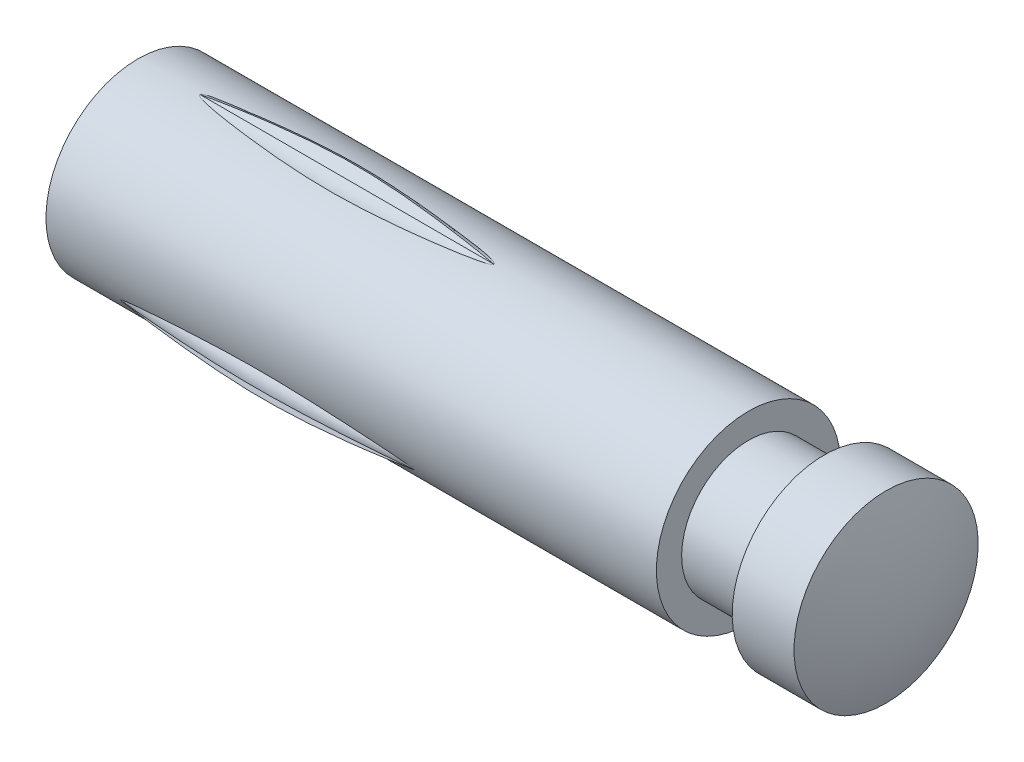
ISO-10303-21;
HEADER;
FILE_DESCRIPTION(('STEP AP214'),'2;1');
FILE_NAME('part.step','',(''),(''),'','','');
FILE_SCHEMA(('AUTOMOTIVE_DESIGN { 1 0 10303 214 1 1 1 1 }'));
ENDSEC;
DATA;
#1=APPLICATION_CONTEXT('core data for automotive mechanical design processes');
#2=APPLICATION_PROTOCOL_DEFINITION('international standard','automotive_design',2000,#1);
#3=PRODUCT_CONTEXT('',#1,'mechanical');
#4=PRODUCT('Part','Part','',(#3));
#5=PRODUCT_RELATED_PRODUCT_CATEGORY('part','',(#4));
#6=PRODUCT_DEFINITION_FORMATION('','',#4);
#7=PRODUCT_DEFINITION_CONTEXT('part definition',#1,'design');
#8=PRODUCT_DEFINITION('design','',#6,#7);
#9=PRODUCT_DEFINITION_SHAPE('','',#8);
#10=(LENGTH_UNIT() NAMED_UNIT(*) SI_UNIT(.MILLI.,.METRE.));
#11=(NAMED_UNIT(*) PLANE_ANGLE_UNIT() SI_UNIT($,.RADIAN.));
#12=(NAMED_UNIT(*) SI_UNIT($,.STERADIAN.) SOLID_ANGLE_UNIT());
#13=UNCERTAINTY_MEASURE_WITH_UNIT(LENGTH_MEASURE(1.E-05),#10,'distance_accuracy_value','');
#14=(GEOMETRIC_REPRESENTATION_CONTEXT(3) GLOBAL_UNCERTAINTY_ASSIGNED_CONTEXT((#13)) GLOBAL_UNIT_ASSIGNED_CONTEXT((#10,
#11,#12)) REPRESENTATION_CONTEXT('',''));
#15=CARTESIAN_POINT('',(0.,0.,0.));
#16=DIRECTION('',(0.,0.,1.));
#17=DIRECTION('',(1.,0.,0.));
#18=AXIS2_PLACEMENT_3D('',#15,#16,#17);
#19=CARTESIAN_POINT('',(-4.99364,0.,0.));
#20=DIRECTION('',(1.,0.,0.));
#21=DIRECTION('',(0.,1.,0.));
#22=AXIS2_PLACEMENT_3D('',#19,#20,#21);
#23=CYLINDRICAL_SURFACE('',#22,1.17221);
#24=CARTESIAN_POINT('',(-4.7625,0.,0.));
#25=DIRECTION('',(1.,0.,0.));
#26=DIRECTION('',(0.,1.,0.));
#27=AXIS2_PLACEMENT_3D('',#24,#25,#26);
#28=CIRCLE('',#27,1.17221);
#29=CARTESIAN_POINT('',(-4.7625,1.17221,0.));
#30=VERTEX_POINT('',#29);
#31=EDGE_CURVE('E241',#30,#30,#28,.T.);
#32=ORIENTED_EDGE('',*,*,#31,.T.);
#33=EDGE_LOOP('',(#32));
#34=FACE_BOUND('',#33,.T.);
#35=CARTESIAN_POINT('',(-0.231173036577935,1.17221,0.));
#36=CARTESIAN_POINT('',(-0.231199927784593,1.17220996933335,-0.0015391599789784));
#37=CARTESIAN_POINT('',(-0.231550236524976,1.17220677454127,-0.00307894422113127));
#38=CARTESIAN_POINT('',(-0.23288520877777,1.17219411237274,-0.00640334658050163));
#39=CARTESIAN_POINT('',(-0.234035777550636,1.17218297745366,-0.00811081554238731));
#40=CARTESIAN_POINT('',(-0.236913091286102,1.17215481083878,-0.0115247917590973));
#41=CARTESIAN_POINT('',(-0.238708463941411,1.17213705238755,-0.0131660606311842));
#42=CARTESIAN_POINT('',(-0.242513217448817,1.17209911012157,-0.0161929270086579));
#43=CARTESIAN_POINT('',(-0.244523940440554,1.17207891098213,-0.017576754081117));
#44=CARTESIAN_POINT('',(-0.25038913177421,1.17201960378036,-0.0212635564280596));
#45=CARTESIAN_POINT('',(-0.254370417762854,1.17197889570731,-0.0233592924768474));
#46=CARTESIAN_POINT('',(-0.262486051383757,1.17189509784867,-0.0272355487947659));
#47=CARTESIAN_POINT('',(-0.266620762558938,1.17185200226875,-0.0290152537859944));
#48=CARTESIAN_POINT('',(-0.279157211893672,1.17172021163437,-0.0340517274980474));
#49=CARTESIAN_POINT('',(-0.28768130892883,1.17162911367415,-0.0370006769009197));
#50=CARTESIAN_POINT('',(-0.31323855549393,1.17135198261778,-0.0451692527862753));
#51=CARTESIAN_POINT('',(-0.33045112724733,1.17116012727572,-0.0497935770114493));
#52=CARTESIAN_POINT('',(-0.365067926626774,1.17076518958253,-0.0583310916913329));
#53=CARTESIAN_POINT('',(-0.382472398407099,1.17056209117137,-0.0622432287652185));
#54=CARTESIAN_POINT('',(-0.417339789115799,1.1701470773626,-0.0696117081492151));
#55=CARTESIAN_POINT('',(-0.434802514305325,1.16993518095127,-0.0730689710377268));
#56=CARTESIAN_POINT('',(-0.469772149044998,1.16950351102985,-0.0796783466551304));
#57=CARTESIAN_POINT('',(-0.487279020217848,1.16928374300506,-0.0828306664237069));
#58=CARTESIAN_POINT('',(-0.53976794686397,1.16861512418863,-0.0919365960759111));
#59=CARTESIAN_POINT('',(-0.574807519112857,1.1681558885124,-0.0975570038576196));
#60=CARTESIAN_POINT('',(-0.64497168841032,1.16721398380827,-0.108240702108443));
#61=CARTESIAN_POINT('',(-0.680096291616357,1.16673131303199,-0.113303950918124));
#62=CARTESIAN_POINT('',(-0.785585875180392,1.16525475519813,-0.127882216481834));
#63=CARTESIAN_POINT('',(-0.856035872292,1.16423272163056,-0.136780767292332));
#64=CARTESIAN_POINT('',(-0.997115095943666,1.16216956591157,-0.153318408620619));
#65=CARTESIAN_POINT('',(-1.06774439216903,1.16112843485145,-0.160956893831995));
#66=CARTESIAN_POINT('',(-1.20911391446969,1.15909766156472,-0.174983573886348));
#67=CARTESIAN_POINT('',(-1.27985411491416,1.15810800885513,-0.18137202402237));
#68=CARTESIAN_POINT('',(-1.42143380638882,1.15625737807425,-0.192817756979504));
#69=CARTESIAN_POINT('',(-1.49227328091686,1.15539638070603,-0.197875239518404));
#70=CARTESIAN_POINT('',(-1.63405007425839,1.15388334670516,-0.206516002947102));
#71=CARTESIAN_POINT('',(-1.70498739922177,1.15323132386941,-0.210099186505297));
#72=CARTESIAN_POINT('',(-1.84686776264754,1.15221057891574,-0.215626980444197));
#73=CARTESIAN_POINT('',(-1.91781074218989,1.15184161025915,-0.217573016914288));
#74=CARTESIAN_POINT('',(-2.05972148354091,1.15145858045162,-0.219592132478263));
#75=CARTESIAN_POINT('',(-2.13068924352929,1.15144449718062,-0.219665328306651));
#76=CARTESIAN_POINT('',(-2.27259281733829,1.1517758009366,-0.217920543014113));
#77=CARTESIAN_POINT('',(-2.34352863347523,1.15212115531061,-0.21610273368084));
#78=CARTESIAN_POINT('',(-2.48534121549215,1.15309930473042,-0.210820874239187));
#79=CARTESIAN_POINT('',(-2.55621797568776,1.15373212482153,-0.207356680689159));
#80=CARTESIAN_POINT('',(-2.69795936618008,1.15521320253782,-0.198939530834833));
#81=CARTESIAN_POINT('',(-2.76882389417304,1.15606170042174,-0.193984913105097));
#82=CARTESIAN_POINT('',(-2.91043346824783,1.15789307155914,-0.182735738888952));
#83=CARTESIAN_POINT('',(-2.9811785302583,1.1588759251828,-0.176441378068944));
#84=CARTESIAN_POINT('',(-3.11537551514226,1.16079589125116,-0.163305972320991));
#85=CARTESIAN_POINT('',(-3.17883930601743,1.16172753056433,-0.156585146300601));
#86=CARTESIAN_POINT('',(-3.3056754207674,1.16358571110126,-0.142117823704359));
#87=CARTESIAN_POINT('',(-3.36904769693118,1.16451225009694,-0.134370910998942));
#88=CARTESIAN_POINT('',(-3.49561540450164,1.1663150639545,-0.117718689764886));
#89=CARTESIAN_POINT('',(-3.55881090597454,1.16719136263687,-0.108813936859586));
#90=CARTESIAN_POINT('',(-3.65334596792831,1.16844488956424,-0.0940028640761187));
#91=CARTESIAN_POINT('',(-3.68479960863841,1.1688523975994,-0.0888263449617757));
#92=CARTESIAN_POINT('',(-3.7475894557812,1.16964464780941,-0.0777170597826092));
#93=CARTESIAN_POINT('',(-3.77892562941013,1.17002938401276,-0.071784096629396));
#94=CARTESIAN_POINT('',(-3.82570913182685,1.17058441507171,-0.0617983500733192));
#95=CARTESIAN_POINT('',(-3.84127220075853,1.17076580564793,-0.0582873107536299));
#96=CARTESIAN_POINT('',(-3.87225551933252,1.17111983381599,-0.0506933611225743));
#97=CARTESIAN_POINT('',(-3.88767587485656,1.17129247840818,-0.0466109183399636));
#98=CARTESIAN_POINT('',(-3.91056454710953,1.17154278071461,-0.0396102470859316));
#99=CARTESIAN_POINT('',(-3.91816587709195,1.17162489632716,-0.0371257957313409));
#100=CARTESIAN_POINT('',(-3.93319341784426,1.1717850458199,-0.0316853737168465));
#101=CARTESIAN_POINT('',(-3.94062002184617,1.17186308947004,-0.0287306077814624));
#102=CARTESIAN_POINT('',(-3.95144919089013,1.17197505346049,-0.0235296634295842));
#103=CARTESIAN_POINT('',(-3.95502815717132,1.1720117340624,-0.0216539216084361));
#104=CARTESIAN_POINT('',(-3.96191762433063,1.17208163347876,-0.0174793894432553));
#105=CARTESIAN_POINT('',(-3.96523019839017,1.17211487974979,-0.0151844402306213));
#106=CARTESIAN_POINT('',(-3.96982592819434,1.17216035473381,-0.0108969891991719));
#107=CARTESIAN_POINT('',(-3.9713659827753,1.17217544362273,-0.00920534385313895));
#108=CARTESIAN_POINT('',(-3.97347702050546,1.17219581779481,-0.00592268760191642));
#109=CARTESIAN_POINT('',(-3.97419903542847,1.17220267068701,-0.00443981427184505));
#110=CARTESIAN_POINT('',(-3.97496153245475,1.17220962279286,-0.00157984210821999));
#111=CARTESIAN_POINT('',(-3.97510201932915,1.17221072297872,-0.00023248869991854));
#112=CARTESIAN_POINT('',(-3.97490557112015,1.17220825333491,0.00242335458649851));
#113=CARTESIAN_POINT('',(-3.97456867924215,1.17220468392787,0.00373184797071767));
#114=CARTESIAN_POINT('',(-3.9733151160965,1.17219183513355,0.0067795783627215));
#115=CARTESIAN_POINT('',(-3.97219906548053,1.17218064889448,0.00842820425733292));
#116=CARTESIAN_POINT('',(-3.96938893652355,1.17215254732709,0.0117488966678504));
#117=CARTESIAN_POINT('',(-3.96762239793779,1.1721349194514,0.0133513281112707));
#118=CARTESIAN_POINT('',(-3.96388212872,1.17209747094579,0.0163073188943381));
#119=CARTESIAN_POINT('',(-3.96190710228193,1.17207763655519,0.0176591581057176));
#120=CARTESIAN_POINT('',(-3.95611035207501,1.17201916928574,0.0212842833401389));
#121=CARTESIAN_POINT('',(-3.95216195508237,1.17197904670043,0.0233495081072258));
#122=CARTESIAN_POINT('',(-3.94411550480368,1.17189657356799,0.0271699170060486));
#123=CARTESIAN_POINT('',(-3.94001709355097,1.17185421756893,0.0289242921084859));
#124=CARTESIAN_POINT('',(-3.92759380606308,1.17172476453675,0.0338900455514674));
#125=CARTESIAN_POINT('',(-3.91914949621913,1.17163536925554,0.0367995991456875));
#126=CARTESIAN_POINT('',(-3.89383391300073,1.17136330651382,0.0448663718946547));
#127=CARTESIAN_POINT('',(-3.87678819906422,1.17117482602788,0.049443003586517));
#128=CARTESIAN_POINT('',(-3.84250983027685,1.17078625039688,0.0579043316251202));
#129=CARTESIAN_POINT('',(-3.82527694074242,1.17058613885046,0.0617880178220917));
#130=CARTESIAN_POINT('',(-3.7907540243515,1.17017665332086,0.0691115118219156));
#131=CARTESIAN_POINT('',(-3.77346418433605,1.16996729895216,0.0725522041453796));
#132=CARTESIAN_POINT('',(-3.73884096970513,1.1695403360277,0.0791355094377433));
#133=CARTESIAN_POINT('',(-3.72150763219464,1.16932273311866,0.0822783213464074));
#134=CARTESIAN_POINT('',(-3.66953251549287,1.16865981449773,0.0913656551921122));
#135=CARTESIAN_POINT('',(-3.63483419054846,1.16820341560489,0.0969854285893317));
#136=CARTESIAN_POINT('',(-3.5653497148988,1.16726820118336,0.107654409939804));
#137=CARTESIAN_POINT('',(-3.53056355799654,1.16678938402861,0.112703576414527));
#138=CARTESIAN_POINT('',(-3.42608778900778,1.1653259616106,0.127228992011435));
#139=CARTESIAN_POINT('',(-3.35631128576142,1.16431478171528,0.136078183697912));
#140=CARTESIAN_POINT('',(-3.21658466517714,1.16227277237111,0.152531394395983));
#141=CARTESIAN_POINT('',(-3.14663448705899,1.16124193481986,0.160134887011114));
#142=CARTESIAN_POINT('',(-3.00662478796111,1.15922811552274,0.174116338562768));
#143=CARTESIAN_POINT('',(-2.93656529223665,1.15824512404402,0.180494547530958));
#144=CARTESIAN_POINT('',(-2.79636277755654,1.15640149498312,0.191951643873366));
#145=CARTESIAN_POINT('',(-2.72621979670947,1.15554081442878,0.197030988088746));
#146=CARTESIAN_POINT('',(-2.58583679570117,1.15401923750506,0.205756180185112));
#147=CARTESIAN_POINT('',(-2.51559676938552,1.15335835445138,0.209401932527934));
#148=CARTESIAN_POINT('',(-2.37508863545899,1.15230919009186,0.215100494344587));
#149=CARTESIAN_POINT('',(-2.30482056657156,1.151920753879,0.217154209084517));
#150=CARTESIAN_POINT('',(-2.16425588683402,1.15148592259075,0.219449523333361));
#151=CARTESIAN_POINT('',(-2.09395927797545,1.15143950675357,0.219691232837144));
#152=CARTESIAN_POINT('',(-1.97413992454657,1.15166554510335,0.218501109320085));
#153=CARTESIAN_POINT('',(-1.92461166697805,1.15184789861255,0.217542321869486));
#154=CARTESIAN_POINT('',(-1.82557925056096,1.15236482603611,0.214787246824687));
#155=CARTESIAN_POINT('',(-1.77607509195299,1.15269940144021,0.212990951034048));
#156=CARTESIAN_POINT('',(-1.62760017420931,1.15389890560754,0.206430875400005));
#157=CARTESIAN_POINT('',(-1.52868205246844,1.15495957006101,0.200496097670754));
#158=CARTESIAN_POINT('',(-1.29650495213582,1.1578125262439,0.183427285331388));
#159=CARTESIAN_POINT('',(-1.16332862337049,1.15973096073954,0.171200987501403));
#160=CARTESIAN_POINT('',(-0.940989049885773,1.16297998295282,0.147139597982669));
#161=CARTESIAN_POINT('',(-0.851695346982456,1.16429732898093,0.136487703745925));
#162=CARTESIAN_POINT('',(-0.702737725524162,1.16641624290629,0.11668012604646));
#163=CARTESIAN_POINT('',(-0.642988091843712,1.16724494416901,0.108184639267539));
#164=CARTESIAN_POINT('',(-0.543380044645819,1.168571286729,0.0925068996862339));
#165=CARTESIAN_POINT('',(-0.503446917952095,1.16908812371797,0.0858126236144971));
#166=CARTESIAN_POINT('',(-0.436911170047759,1.1699165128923,0.0734612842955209));
#167=CARTESIAN_POINT('',(-0.410239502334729,1.17023972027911,0.0681860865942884));
#168=CARTESIAN_POINT('',(-0.365829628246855,1.17076066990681,0.0584071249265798));
#169=CARTESIAN_POINT('',(-0.348024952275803,1.17096485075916,0.0542160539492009));
#170=CARTESIAN_POINT('',(-0.318411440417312,1.17129576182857,0.0463952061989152));
#171=CARTESIAN_POINT('',(-0.306535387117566,1.17142608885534,0.0430260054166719));
#172=CARTESIAN_POINT('',(-0.286807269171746,1.17163828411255,0.0366974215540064));
#173=CARTESIAN_POINT('',(-0.278889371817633,1.17172225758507,0.0339546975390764));
#174=CARTESIAN_POINT('',(-0.26578528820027,1.17185916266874,0.0287533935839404));
#175=CARTESIAN_POINT('',(-0.260526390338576,1.17191351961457,0.0264788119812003));
#176=CARTESIAN_POINT('',(-0.250702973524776,1.1720139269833,0.021575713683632));
#177=CARTESIAN_POINT('',(-0.246117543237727,1.17206029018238,0.0189941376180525));
#178=CARTESIAN_POINT('',(-0.239612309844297,1.17212545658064,0.0141785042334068));
#179=CARTESIAN_POINT('',(-0.237432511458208,1.17214716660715,0.0123254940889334));
#180=CARTESIAN_POINT('',(-0.234289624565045,1.17217840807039,0.00872737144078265));
#181=CARTESIAN_POINT('',(-0.233161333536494,1.17218960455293,0.00714284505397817));
#182=CARTESIAN_POINT('',(-0.231782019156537,1.1722034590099,0.00410854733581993));
#183=CARTESIAN_POINT('',(-0.231376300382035,1.17220760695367,0.00273813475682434));
#184=CARTESIAN_POINT('',(-0.231184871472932,1.17220974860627,0.000897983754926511));
#185=CARTESIAN_POINT('',(-0.231165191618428,1.17221000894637,0.000449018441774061));
#186=CARTESIAN_POINT('',(-0.231173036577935,1.17221,0.));
#187=B_SPLINE_CURVE_WITH_KNOTS('',3,(#35,#36,#37,#38,#39,#40,#41,#42,#43,#44,#45,#46,#47,#48,
#49,#50,#51,#52,#53,#54,#55,#56,#57,#58,#59,#60,#61,#62,#63,#64,#65,#66,#67,#68,#69,#70,#71,#72,
#73,#74,#75,#76,#77,#78,#79,#80,#81,#82,#83,#84,#85,#86,#87,#88,#89,#90,#91,#92,#93,#94,#95,#96,
#97,#98,#99,#100,#101,#102,#103,#104,#105,#106,#107,#108,#109,#110,#111,#112,#113,#114,#115,
#116,#117,#118,#119,#120,#121,#122,#123,#124,#125,#126,#127,#128,#129,#130,#131,#132,#133,#134,
#135,#136,#137,#138,#139,#140,#141,#142,#143,#144,#145,#146,#147,#148,#149,#150,#151,#152,#153,
#154,#155,#156,#157,#158,#159,#160,#161,#162,#163,#164,#165,#166,#167,#168,#169,#170,#171,#172,
#173,#174,#175,#176,#177,#178,#179,#180,#181,#182,#183,#184,#185,#186),.UNSPECIFIED.,.T.,.F.,(4,
2,2,2,2,2,2,2,2,2,2,2,2,2,2,2,2,2,2,2,2,2,2,2,2,2,2,2,2,2,2,2,2,2,2,2,2,2,2,2,2,2,2,2,2,2,2,2,2,
2,2,2,2,2,2,2,2,2,2,2,2,2,2,2,2,2,2,2,2,2,2,2,2,2,2,4),(0.,0.00461329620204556,
0.0106891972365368,0.0179510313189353,0.0252610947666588,0.0387266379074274,0.0522264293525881,
0.079259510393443,0.132695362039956,0.186209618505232,0.239613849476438,0.292981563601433,
0.399444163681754,0.505914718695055,0.718949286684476,0.932085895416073,1.14517892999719,
1.35823997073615,1.57131507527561,1.78420438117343,1.99708041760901,2.20993711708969,
2.42281236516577,2.6359257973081,2.84900812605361,3.04047610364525,3.23202197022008,
3.42347625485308,3.51911175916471,3.61477223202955,3.66263569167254,3.71046021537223,
3.73445011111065,3.75837951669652,3.77049418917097,3.78250296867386,3.78930099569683,
3.79416620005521,3.79814730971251,3.8021280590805,3.80799959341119,3.81512030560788,
3.82228821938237,3.83562403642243,3.84899406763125,3.8757630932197,3.92868003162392,
3.98167349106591,4.0345594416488,4.08740981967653,4.19286143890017,4.29832071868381,
4.50933169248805,4.72043160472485,4.93148839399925,5.1424708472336,5.35346735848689,
5.56434380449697,5.77520744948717,5.92381324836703,6.07242050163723,6.36968022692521,
6.7708485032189,7.04063571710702,7.22168847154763,7.3431549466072,7.42471261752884,
7.47957414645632,7.51659769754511,7.54171465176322,7.55889620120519,7.57460753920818,
7.58313330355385,7.58888874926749,7.59308838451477,7.59443421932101),.UNSPECIFIED.);
#188=CARTESIAN_POINT('',(-3.97503316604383,1.17221,0.));
#189=VERTEX_POINT('',#188);
#190=CARTESIAN_POINT('',(-0.231173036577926,1.17221,0.));
#191=VERTEX_POINT('',#190);
#192=EDGE_CURVE('E244',#189,#191,#187,.T.);
#193=ORIENTED_EDGE('',*,*,#192,.F.);
#194=EDGE_CURVE('E245',#191,#189,#187,.T.);
#195=ORIENTED_EDGE('',*,*,#194,.F.);
#196=EDGE_LOOP('',(#193,#195));
#197=FACE_BOUND('',#196,.T.);
#198=CARTESIAN_POINT('',(-0.231171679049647,-0.585952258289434,-1.01525180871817));
#199=CARTESIAN_POINT('',(-0.231172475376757,-0.587268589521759,-1.01449207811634));
#200=CARTESIAN_POINT('',(-0.231490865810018,-0.588583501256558,-1.01372958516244));
#201=CARTESIAN_POINT('',(-0.232744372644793,-0.591409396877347,-1.01208435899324));
#202=CARTESIAN_POINT('',(-0.233836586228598,-0.592859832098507,-1.0112347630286));
#203=CARTESIAN_POINT('',(-0.237489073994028,-0.596734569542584,-1.00895644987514));
#204=CARTESIAN_POINT('',(-0.240472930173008,-0.598819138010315,-1.00771870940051));
#205=CARTESIAN_POINT('',(-0.246545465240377,-0.602433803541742,-1.00556134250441));
#206=CARTESIAN_POINT('',(-0.249617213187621,-0.603989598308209,-1.00462712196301));
#207=CARTESIAN_POINT('',(-0.255906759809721,-0.606868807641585,-1.00289051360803));
#208=CARTESIAN_POINT('',(-0.259124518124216,-0.608192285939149,-1.00208808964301));
#209=CARTESIAN_POINT('',(-0.268924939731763,-0.611951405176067,-0.999800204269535));
#210=CARTESIAN_POINT('',(-0.275620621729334,-0.614158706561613,-0.998444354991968));
#211=CARTESIAN_POINT('',(-0.295717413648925,-0.620258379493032,-0.994675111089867));
#212=CARTESIAN_POINT('',(-0.309296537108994,-0.623697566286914,-0.992518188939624));
#213=CARTESIAN_POINT('',(-0.336634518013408,-0.630024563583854,-0.988513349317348));
#214=CARTESIAN_POINT('',(-0.350393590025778,-0.63291163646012,-0.986665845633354));
#215=CARTESIAN_POINT('',(-0.377966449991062,-0.638329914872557,-0.983169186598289));
#216=CARTESIAN_POINT('',(-0.391779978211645,-0.640862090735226,-0.98151949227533));
#217=CARTESIAN_POINT('',(-0.419452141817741,-0.645689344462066,-0.97835053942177));
#218=CARTESIAN_POINT('',(-0.433310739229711,-0.647984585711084,-0.976831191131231));
#219=CARTESIAN_POINT('',(-0.474851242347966,-0.654597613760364,-0.972423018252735));
#220=CARTESIAN_POINT('',(-0.502588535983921,-0.65865947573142,-0.96967316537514));
#221=CARTESIAN_POINT('',(-0.558146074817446,-0.666346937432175,-0.964406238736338));
#222=CARTESIAN_POINT('',(-0.585966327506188,-0.669972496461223,-0.961889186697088));
#223=CARTESIAN_POINT('',(-0.669531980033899,-0.680395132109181,-0.954573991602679));
#224=CARTESIAN_POINT('',(-0.725355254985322,-0.686734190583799,-0.950014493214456));
#225=CARTESIAN_POINT('',(-0.837141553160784,-0.698606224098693,-0.941317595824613));
#226=CARTESIAN_POINT('',(-0.893104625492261,-0.704138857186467,-0.93718037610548));
#227=CARTESIAN_POINT('',(-1.00511030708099,-0.714504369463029,-0.929302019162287));
#228=CARTESIAN_POINT('',(-1.06115289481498,-0.719337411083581,-0.925560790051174));
#229=CARTESIAN_POINT('',(-1.17324197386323,-0.728332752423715,-0.918498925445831));
#230=CARTESIAN_POINT('',(-1.22928835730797,-0.73249595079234,-0.915177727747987));
#231=CARTESIAN_POINT('',(-1.34145600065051,-0.740147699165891,-0.909000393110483));
#232=CARTESIAN_POINT('',(-1.39757726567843,-0.7436362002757,-0.906144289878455));
#233=CARTESIAN_POINT('',(-1.56604129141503,-0.753044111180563,-0.898369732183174));
#234=CARTESIAN_POINT('',(-1.67848665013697,-0.757906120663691,-0.894244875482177));
#235=CARTESIAN_POINT('',(-1.84734535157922,-0.762773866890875,-0.89008781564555));
#236=CARTESIAN_POINT('',(-1.90370158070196,-0.763992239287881,-0.88904047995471));
#237=CARTESIAN_POINT('',(-2.01644006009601,-0.765541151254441,-0.887707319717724));
#238=CARTESIAN_POINT('',(-2.07282231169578,-0.765871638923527,-0.887421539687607));
#239=CARTESIAN_POINT('',(-2.18548800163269,-0.765585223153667,-0.887668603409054));
#240=CARTESIAN_POINT('',(-2.24177144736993,-0.764969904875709,-0.888200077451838));
#241=CARTESIAN_POINT('',(-2.35429704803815,-0.7628834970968,-0.889992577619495));
#242=CARTESIAN_POINT('',(-2.41053920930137,-0.761412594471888,-0.891253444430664));
#243=CARTESIAN_POINT('',(-2.57746474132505,-0.755871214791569,-0.895968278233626));
#244=CARTESIAN_POINT('',(-2.68808634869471,-0.750662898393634,-0.900363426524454));
#245=CARTESIAN_POINT('',(-2.85388222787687,-0.740830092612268,-0.908440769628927));
#246=CARTESIAN_POINT('',(-2.90915851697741,-0.737212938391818,-0.911382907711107));
#247=CARTESIAN_POINT('',(-3.01963623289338,-0.729328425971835,-0.917704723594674));
#248=CARTESIAN_POINT('',(-3.07483766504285,-0.725061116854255,-0.921084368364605));
#249=CARTESIAN_POINT('',(-3.18579082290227,-0.715828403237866,-0.928278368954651));
#250=CARTESIAN_POINT('',(-3.24154163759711,-0.710855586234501,-0.932097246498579));
#251=CARTESIAN_POINT('',(-3.35296038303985,-0.700198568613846,-0.940129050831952));
#252=CARTESIAN_POINT('',(-3.40862829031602,-0.694514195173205,-0.944342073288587));
#253=CARTESIAN_POINT('',(-3.51968893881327,-0.682312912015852,-0.95319639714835));
#254=CARTESIAN_POINT('',(-3.57508201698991,-0.675798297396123,-0.957836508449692));
#255=CARTESIAN_POINT('',(-3.65797831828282,-0.664993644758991,-0.965338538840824));
#256=CARTESIAN_POINT('',(-3.68557305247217,-0.661220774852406,-0.967928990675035));
#257=CARTESIAN_POINT('',(-3.74065900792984,-0.653162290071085,-0.973385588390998));
#258=CARTESIAN_POINT('',(-3.76815024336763,-0.648876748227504,-0.976251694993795));
#259=CARTESIAN_POINT('',(-3.80931141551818,-0.641784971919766,-0.980916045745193));
#260=CARTESIAN_POINT('',(-3.82305600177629,-0.639302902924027,-0.982536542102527));
#261=CARTESIAN_POINT('',(-3.85050953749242,-0.634001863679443,-0.985965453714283));
#262=CARTESIAN_POINT('',(-3.86421816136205,-0.631181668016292,-0.987774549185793));
#263=CARTESIAN_POINT('',(-3.89129276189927,-0.625074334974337,-0.991651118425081));
#264=CARTESIAN_POINT('',(-3.90466081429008,-0.621794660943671,-0.993714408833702));
#265=CARTESIAN_POINT('',(-3.92437683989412,-0.616098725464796,-0.997247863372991));
#266=CARTESIAN_POINT('',(-3.93087920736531,-0.614075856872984,-0.998495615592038));
#267=CARTESIAN_POINT('',(-3.94370357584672,-0.609593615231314,-1.00123890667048));
#268=CARTESIAN_POINT('',(-3.95002556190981,-0.607134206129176,-1.00273446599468));
#269=CARTESIAN_POINT('',(-3.95829819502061,-0.603090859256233,-1.00516627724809));
#270=CARTESIAN_POINT('',(-3.96051337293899,-0.601919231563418,-1.00586862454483));
#271=CARTESIAN_POINT('',(-3.96477049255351,-0.599365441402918,-1.00739247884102));
#272=CARTESIAN_POINT('',(-3.96681323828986,-0.5979843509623,-1.00821337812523));
#273=CARTESIAN_POINT('',(-3.97001894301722,-0.595315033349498,-1.00979106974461));
#274=CARTESIAN_POINT('',(-3.97126872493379,-0.594107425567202,-1.01050241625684));
#275=CARTESIAN_POINT('',(-3.97338682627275,-0.591410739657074,-1.01208301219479));
#276=CARTESIAN_POINT('',(-3.974251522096,-0.589919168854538,-1.01295365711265));
#277=CARTESIAN_POINT('',(-3.97500621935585,-0.587208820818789,-1.01452634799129));
#278=CARTESIAN_POINT('',(-3.97510970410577,-0.586040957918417,-1.01520146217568));
#279=CARTESIAN_POINT('',(-3.97484511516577,-0.583748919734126,-1.01652115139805));
#280=CARTESIAN_POINT('',(-3.97447741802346,-0.582624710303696,-1.01716575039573));
#281=CARTESIAN_POINT('',(-3.97313822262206,-0.579951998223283,-1.01869303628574));
#282=CARTESIAN_POINT('',(-3.9719505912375,-0.578492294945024,-1.01952206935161));
#283=CARTESIAN_POINT('',(-3.96893368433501,-0.57550195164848,-1.02121372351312));
#284=CARTESIAN_POINT('',(-3.96701817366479,-0.574045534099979,-1.02203250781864));
#285=CARTESIAN_POINT('',(-3.96297424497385,-0.571361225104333,-1.02353550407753));
#286=CARTESIAN_POINT('',(-3.96084448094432,-0.570134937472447,-1.02421877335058));
#287=CARTESIAN_POINT('',(-3.9544739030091,-0.566777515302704,-1.02608286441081));
#288=CARTESIAN_POINT('',(-3.9500934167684,-0.564851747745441,-1.02714317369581));
#289=CARTESIAN_POINT('',(-3.94117683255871,-0.561290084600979,-1.02909360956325));
#290=CARTESIAN_POINT('',(-3.93664036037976,-0.559654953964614,-1.02998328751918));
#291=CARTESIAN_POINT('',(-3.92290082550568,-0.555025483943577,-1.03248998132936));
#292=CARTESIAN_POINT('',(-3.91357488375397,-0.55231020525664,-1.03394292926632));
#293=CARTESIAN_POINT('',(-3.88562905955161,-0.544767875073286,-1.03794814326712));
#294=CARTESIAN_POINT('',(-3.86683241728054,-0.540469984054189,-1.04018726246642));
#295=CARTESIAN_POINT('',(-3.82904889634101,-0.532498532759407,-1.04428957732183));
#296=CARTESIAN_POINT('',(-3.81006179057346,-0.528825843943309,-1.04615224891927));
#297=CARTESIAN_POINT('',(-3.77203296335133,-0.521880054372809,-1.04963453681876));
#298=CARTESIAN_POINT('',(-3.75299143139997,-0.518606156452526,-1.05125463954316));
#299=CARTESIAN_POINT('',(-3.71486440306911,-0.512326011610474,-1.05432936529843));
#300=CARTESIAN_POINT('',(-3.69577894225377,-0.509319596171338,-1.05578409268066));
#301=CARTESIAN_POINT('',(-3.63853763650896,-0.500606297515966,-1.05995821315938));
#302=CARTESIAN_POINT('',(-3.60032382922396,-0.495192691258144,-1.06249383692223));
#303=CARTESIAN_POINT('',(-3.52380562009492,-0.484883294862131,-1.06723764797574));
#304=CARTESIAN_POINT('',(-3.4855012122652,-0.479987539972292,-1.06944581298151));
#305=CARTESIAN_POINT('',(-3.37046547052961,-0.465875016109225,-1.07570602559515));
#306=CARTESIAN_POINT('',(-3.29364283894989,-0.45723746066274,-1.07939168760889));
#307=CARTESIAN_POINT('',(-3.13980255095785,-0.441232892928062,-1.08603117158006));
#308=CARTESIAN_POINT('',(-3.06278482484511,-0.433866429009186,-1.0889846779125));
#309=CARTESIAN_POINT('',(-2.90862189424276,-0.420488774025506,-1.09421992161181));
#310=CARTESIAN_POINT('',(-2.83147671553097,-0.41447733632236,-1.09650178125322));
#311=CARTESIAN_POINT('',(-2.67705876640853,-0.403984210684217,-1.10041101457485));
#312=CARTESIAN_POINT('',(-2.59978598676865,-0.399502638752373,-1.1020383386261));
#313=CARTESIAN_POINT('',(-2.44514309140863,-0.392294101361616,-1.10462499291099));
#314=CARTESIAN_POINT('',(-2.36777297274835,-0.389567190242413,-1.10558430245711));
#315=CARTESIAN_POINT('',(-2.21302177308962,-0.386148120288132,-1.10678340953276));
#316=CARTESIAN_POINT('',(-2.1356407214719,-0.385454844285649,-1.10702360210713));
#317=CARTESIAN_POINT('',(-1.98089515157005,-0.386284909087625,-1.10673403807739));
#318=CARTESIAN_POINT('',(-1.90353063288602,-0.387808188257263,-1.10620430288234));
#319=CARTESIAN_POINT('',(-1.73782135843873,-0.39311165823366,-1.10433171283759));
#320=CARTESIAN_POINT('',(-1.64948748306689,-0.397183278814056,-1.10288347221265));
#321=CARTESIAN_POINT('',(-1.47295336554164,-0.407460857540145,-1.09912764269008));
#322=CARTESIAN_POINT('',(-1.38475314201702,-0.413667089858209,-1.09681994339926));
#323=CARTESIAN_POINT('',(-1.23720712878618,-0.425590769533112,-1.09223408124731));
#324=CARTESIAN_POINT('',(-1.17781287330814,-0.430809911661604,-1.09019074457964));
#325=CARTESIAN_POINT('',(-1.05911811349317,-0.442028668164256,-1.08569021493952));
#326=CARTESIAN_POINT('',(-0.999817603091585,-0.448028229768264,-1.08323304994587));
#327=CARTESIAN_POINT('',(-0.860948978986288,-0.462982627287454,-1.07694535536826));
#328=CARTESIAN_POINT('',(-0.78142135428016,-0.472244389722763,-1.07293308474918));
#329=CARTESIAN_POINT('',(-0.648809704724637,-0.489244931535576,-1.06525690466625));
#330=CARTESIAN_POINT('',(-0.595644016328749,-0.496480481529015,-1.06191357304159));
#331=CARTESIAN_POINT('',(-0.507048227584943,-0.509738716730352,-1.05559351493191));
#332=CARTESIAN_POINT('',(-0.471544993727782,-0.515375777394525,-1.05285882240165));
#333=CARTESIAN_POINT('',(-0.412419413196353,-0.525733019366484,-1.04771314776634));
#334=CARTESIAN_POINT('',(-0.388728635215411,-0.530145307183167,-1.04549134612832));
#335=CARTESIAN_POINT('',(-0.34930846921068,-0.538306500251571,-1.04130500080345));
#336=CARTESIAN_POINT('',(-0.3335117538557,-0.541799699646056,-1.03949435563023));
#337=CARTESIAN_POINT('',(-0.307257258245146,-0.548309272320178,-1.03607051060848));
#338=CARTESIAN_POINT('',(-0.296732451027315,-0.551111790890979,-1.03458431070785));
#339=CARTESIAN_POINT('',(-0.279276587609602,-0.556377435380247,-1.03175884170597));
#340=CARTESIAN_POINT('',(-0.272276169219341,-0.558660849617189,-1.03052548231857));
#341=CARTESIAN_POINT('',(-0.260699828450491,-0.562987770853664,-1.02816591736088));
#342=CARTESIAN_POINT('',(-0.256053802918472,-0.564880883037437,-1.02712799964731));
#343=CARTESIAN_POINT('',(-0.249315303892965,-0.568089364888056,-1.02535467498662));
#344=CARTESIAN_POINT('',(-0.247108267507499,-0.569219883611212,-1.02472774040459));
#345=CARTESIAN_POINT('',(-0.2428358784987,-0.57166398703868,-1.02336628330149));
#346=CARTESIAN_POINT('',(-0.240770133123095,-0.572977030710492,-1.02263207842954));
#347=CARTESIAN_POINT('',(-0.237237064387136,-0.575655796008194,-1.02112618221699));
#348=CARTESIAN_POINT('',(-0.235727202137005,-0.576977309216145,-1.02038053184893));
#349=CARTESIAN_POINT('',(-0.233341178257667,-0.579728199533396,-1.01881969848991));
#350=CARTESIAN_POINT('',(-0.232404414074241,-0.581112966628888,-1.01803096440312));
#351=CARTESIAN_POINT('',(-0.231405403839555,-0.583686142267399,-1.01655706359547));
#352=CARTESIAN_POINT('',(-0.231170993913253,-0.584819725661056,-1.01590545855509));
#353=CARTESIAN_POINT('',(-0.231171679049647,-0.585952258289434,-1.01525180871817));
#354=B_SPLINE_CURVE_WITH_KNOTS('',3,(#198,#199,#200,#201,#202,#203,#204,#205,#206,#207,#208,
#209,#210,#211,#212,#213,#214,#215,#216,#217,#218,#219,#220,#221,#222,#223,#224,#225,#226,#227,
#228,#229,#230,#231,#232,#233,#234,#235,#236,#237,#238,#239,#240,#241,#242,#243,#244,#245,#246,
#247,#248,#249,#250,#251,#252,#253,#254,#255,#256,#257,#258,#259,#260,#261,#262,#263,#264,#265,
#266,#267,#268,#269,#270,#271,#272,#273,#274,#275,#276,#277,#278,#279,#280,#281,#282,#283,#284,
#285,#286,#287,#288,#289,#290,#291,#292,#293,#294,#295,#296,#297,#298,#299,#300,#301,#302,#303,
#304,#305,#306,#307,#308,#309,#310,#311,#312,#313,#314,#315,#316,#317,#318,#319,#320,#321,#322,
#323,#324,#325,#326,#327,#328,#329,#330,#331,#332,#333,#334,#335,#336,#337,#338,#339,#340,#341,
#342,#343,#344,#345,#346,#347,#348,#349,#350,#351,#352,#353),.UNSPECIFIED.,.T.,.F.,(4,2,2,2,2,2,
2,2,2,2,2,2,2,2,2,2,2,2,2,2,2,2,2,2,2,2,2,2,2,2,2,2,2,2,2,2,2,2,2,2,2,2,2,2,2,2,2,2,2,2,2,2,2,2,
2,2,2,2,2,2,2,2,2,2,2,2,2,2,2,2,2,2,2,2,2,2,2,4),(0.,0.0045433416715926,0.0104575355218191,
0.0218407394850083,0.0325434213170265,0.0432431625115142,0.0647602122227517,0.107238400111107,
0.149772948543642,0.19218883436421,0.23457527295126,0.319069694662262,0.403571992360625,
0.572658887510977,0.741817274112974,0.910936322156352,1.0798265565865,1.24872902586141,
1.58652682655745,1.75565488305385,1.924792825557,2.09364760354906,2.26246551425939,
2.59488685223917,2.761301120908,2.92770283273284,3.09600396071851,3.26434604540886,
3.43223247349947,3.51614428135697,3.60004415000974,3.64222123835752,3.68455608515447,
3.72626938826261,3.74703686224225,3.76780605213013,3.77560609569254,3.78336748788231,
3.78897467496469,3.79463356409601,3.79860840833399,3.80258007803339,3.80864573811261,
3.81623447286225,3.82387427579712,3.83854211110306,3.85324799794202,3.88268389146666,
3.94088372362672,3.99916402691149,4.05732584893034,4.11545076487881,4.23147747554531,
4.34751207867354,4.57967608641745,4.81194000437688,5.04416161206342,5.27640082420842,
5.50864722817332,5.74076602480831,5.97287836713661,6.23816250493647,6.50348072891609,
6.68244886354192,6.86140490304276,7.10187959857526,7.26314411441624,7.37128567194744,
7.44387245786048,7.49269625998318,7.52565630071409,7.54803882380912,7.56338218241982,
7.57104868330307,7.57869292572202,7.58507950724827,7.59052472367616,7.59443368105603),.UNSPECIFIED.);
#355=CARTESIAN_POINT('',(-3.97503316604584,-0.586104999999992,-1.01516363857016));
#356=VERTEX_POINT('',#355);
#357=CARTESIAN_POINT('',(-0.231173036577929,-0.586104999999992,-1.01516363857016));
#358=VERTEX_POINT('',#357);
#359=EDGE_CURVE('E130',#356,#358,#354,.T.);
#360=ORIENTED_EDGE('',*,*,#359,.F.);
#361=EDGE_CURVE('E120',#358,#356,#354,.T.);
#362=ORIENTED_EDGE('',*,*,#361,.F.);
#363=EDGE_LOOP('',(#360,#362));
#364=FACE_BOUND('',#363,.T.);
#365=CARTESIAN_POINT('',(-0.231171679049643,-0.586257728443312,1.0150754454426));
#366=CARTESIAN_POINT('',(-0.231172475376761,-0.584941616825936,1.01583555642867));
#367=CARTESIAN_POINT('',(-0.231490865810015,-0.583623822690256,1.01659305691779));
#368=CARTESIAN_POINT('',(-0.232744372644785,-0.580786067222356,1.01821774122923));
#369=CARTESIAN_POINT('',(-0.233836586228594,-0.579325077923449,1.01904905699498));
#370=CARTESIAN_POINT('',(-0.237489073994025,-0.575414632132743,1.02126552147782));
#371=CARTESIAN_POINT('',(-0.240472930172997,-0.573300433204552,1.02245194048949));
#372=CARTESIAN_POINT('',(-0.246545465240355,-0.569624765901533,1.02450364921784));
#373=CARTESIAN_POINT('',(-0.249617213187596,-0.568037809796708,1.02538389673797));
#374=CARTESIAN_POINT('',(-0.25590675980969,-0.565094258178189,1.027009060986));
#375=CARTESIAN_POINT('',(-0.259124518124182,-0.563737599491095,1.02775401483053));
#376=CARTESIAN_POINT('',(-0.268924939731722,-0.559876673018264,1.02986556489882));
#377=CARTESIAN_POINT('',(-0.275620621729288,-0.557598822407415,1.03109921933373));
#378=CARTESIAN_POINT('',(-0.295717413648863,-0.551284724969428,1.03449706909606));
#379=CARTESIAN_POINT('',(-0.309296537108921,-0.547697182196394,1.0363970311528));
#380=CARTESIAN_POINT('',(-0.336634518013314,-0.541065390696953,1.03987395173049));
#381=CARTESIAN_POINT('',(-0.350393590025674,-0.538021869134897,1.04145047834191));
#382=CARTESIAN_POINT('',(-0.377966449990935,-0.532284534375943,1.04439451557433));
#383=CARTESIAN_POINT('',(-0.391779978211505,-0.529589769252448,1.04576259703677));
#384=CARTESIAN_POINT('',(-0.419452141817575,-0.524431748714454,1.04835864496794));
#385=CARTESIAN_POINT('',(-0.433310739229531,-0.521968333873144,1.04958670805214));
#386=CARTESIAN_POINT('',(-0.47485124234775,-0.514844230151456,1.0531096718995));
#387=CARTESIAN_POINT('',(-0.502588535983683,-0.510431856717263,1.0552524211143));
#388=CARTESIAN_POINT('',(-0.558146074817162,-0.502026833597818,1.05927649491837));
#389=CARTESIAN_POINT('',(-0.585966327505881,-0.498034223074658,1.06115779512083));
#390=CARTESIAN_POINT('',(-0.669531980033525,-0.486487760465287,1.06652646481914));
#391=CARTESIAN_POINT('',(-0.725355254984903,-0.479369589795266,1.06973650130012));
#392=CARTESIAN_POINT('',(-0.83714155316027,-0.465901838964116,1.07566953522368));
#393=CARTESIAN_POINT('',(-0.893104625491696,-0.459552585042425,1.07839232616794));
#394=CARTESIAN_POINT('',(-1.00511030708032,-0.447546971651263,1.08342994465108));
#395=CARTESIAN_POINT('',(-1.06115289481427,-0.441890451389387,1.08574486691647));
#396=CARTESIAN_POINT('',(-1.1732419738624,-0.431277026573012,1.09000412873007));
#397=CARTESIAN_POINT('',(-1.22928835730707,-0.426319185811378,1.09194896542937));
#398=CARTESIAN_POINT('',(-1.34145600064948,-0.417143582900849,1.09548690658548));
#399=CARTESIAN_POINT('',(-1.39757726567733,-0.412925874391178,1.09707998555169));
#400=CARTESIAN_POINT('',(-1.5660412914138,-0.401488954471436,1.1013401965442));
#401=CARTESIAN_POINT('',(-1.67848665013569,-0.395485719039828,1.10348839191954));
#402=CARTESIAN_POINT('',(-1.8473453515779,-0.389451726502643,1.10562545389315));
#403=CARTESIAN_POINT('',(-1.90370158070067,-0.387935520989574,1.10615692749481));
#404=CARTESIAN_POINT('',(-2.01644006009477,-0.386006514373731,1.10683174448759));
#405=CARTESIAN_POINT('',(-2.07282231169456,-0.385593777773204,1.1069750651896));
#406=CARTESIAN_POINT('',(-2.18548800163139,-0.385950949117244,1.10685055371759));
#407=CARTESIAN_POINT('',(-2.24177144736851,-0.386718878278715,1.10658340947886));
#408=CARTESIAN_POINT('',(-2.35429704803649,-0.389314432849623,1.10567277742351));
#409=CARTESIAN_POINT('',(-2.41053920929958,-0.391141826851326,1.10502937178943));
#410=CARTESIAN_POINT('',(-2.57746474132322,-0.397995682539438,1.10258781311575));
#411=CARTESIAN_POINT('',(-2.68808634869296,-0.40440615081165,1.10027485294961));
#412=CARTESIAN_POINT('',(-2.85388222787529,-0.416317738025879,1.09579806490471));
#413=CARTESIAN_POINT('',(-2.90915851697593,-0.420674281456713,1.09413658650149));
#414=CARTESIAN_POINT('',(-3.01963623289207,-0.430091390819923,1.09046930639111));
#415=CARTESIAN_POINT('',(-3.07483766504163,-0.435151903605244,1.08846353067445));
#416=CARTESIAN_POINT('',(-3.18579082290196,-0.445998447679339,1.08406476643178));
#417=CARTESIAN_POINT('',(-3.24154163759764,-0.451792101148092,1.08166761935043));
#418=CARTESIAN_POINT('',(-3.35296038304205,-0.464076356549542,1.07645427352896));
#419=CARTESIAN_POINT('',(-3.40862829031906,-0.470567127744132,1.07363797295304));
#420=CARTESIAN_POINT('',(-3.51968893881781,-0.484335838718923,1.06749851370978));
#421=CARTESIAN_POINT('',(-3.57508201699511,-0.491611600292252,1.06417674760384));
#422=CARTESIAN_POINT('',(-3.65797831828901,-0.503510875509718,1.05857065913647));
#423=CARTESIAN_POINT('',(-3.68557305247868,-0.507640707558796,1.05659848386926));
#424=CARTESIAN_POINT('',(-3.74065900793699,-0.516395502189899,1.0523479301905));
#425=CARTESIAN_POINT('',(-3.7681502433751,-0.521020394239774,1.05006959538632));
#426=CARTESIAN_POINT('',(-3.80931141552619,-0.528605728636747,1.04626011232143));
#427=CARTESIAN_POINT('',(-3.82305600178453,-0.531250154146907,1.04492082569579));
#428=CARTESIAN_POINT('',(-3.85050953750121,-0.536870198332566,1.04204444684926));
#429=CARTESIAN_POINT('',(-3.86421816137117,-0.539847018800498,1.04050663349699));
#430=CARTESIAN_POINT('',(-3.89129276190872,-0.546257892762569,1.03715581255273));
#431=CARTESIAN_POINT('',(-3.90466081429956,-0.549684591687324,1.03534717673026));
#432=CARTESIAN_POINT('',(-3.92437683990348,-0.555592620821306,1.03218107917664));
#433=CARTESIAN_POINT('',(-3.93087920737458,-0.55768464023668,1.03105309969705));
#434=CARTESIAN_POINT('',(-3.94370357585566,-0.562301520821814,1.02854301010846));
#435=CARTESIAN_POINT('',(-3.95002556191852,-0.564826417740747,1.02716087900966));
#436=CARTESIAN_POINT('',(-3.95829819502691,-0.568954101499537,1.02487514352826));
#437=CARTESIAN_POINT('',(-3.96051337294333,-0.570148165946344,1.02421165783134));
#438=CARTESIAN_POINT('',(-3.96477049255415,-0.572744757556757,1.02276193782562));
#439=CARTESIAN_POINT('',(-3.96681323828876,-0.574146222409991,1.02197632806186));
#440=CARTESIAN_POINT('',(-3.97001894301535,-0.576847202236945,1.02045347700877));
#441=CARTESIAN_POINT('',(-3.97126872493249,-0.57806705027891,1.01976333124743));
#442=CARTESIAN_POINT('',(-3.97338682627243,-0.580784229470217,1.01821823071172));
#443=CARTESIAN_POINT('',(-3.97425152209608,-0.58228401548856,1.0173618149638));
#444=CARTESIAN_POINT('',(-3.97500621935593,-0.585001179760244,1.01580093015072));
#445=CARTESIAN_POINT('',(-3.97510970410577,-0.586169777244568,1.01512708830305));
#446=CARTESIAN_POINT('',(-3.97484511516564,-0.588458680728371,1.01380196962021));
#447=CARTESIAN_POINT('',(-3.97447741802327,-0.589579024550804,1.01315067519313));
#448=CARTESIAN_POINT('',(-3.97313822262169,-0.592238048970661,1.01159968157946));
#449=CARTESIAN_POINT('',(-3.97195059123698,-0.593685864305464,1.0107500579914));
#450=CARTESIAN_POINT('',(-3.96893368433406,-0.596646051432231,1.00900617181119));
#451=CARTESIAN_POINT('',(-3.96701817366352,-0.598083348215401,1.00815426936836));
#452=CARTESIAN_POINT('',(-3.96297424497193,-0.600727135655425,1.00658108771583));
#453=CARTESIAN_POINT('',(-3.96084448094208,-0.601932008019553,1.00586072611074));
#454=CARTESIAN_POINT('',(-3.95447390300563,-0.605225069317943,1.00388515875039));
#455=CARTESIAN_POINT('',(-3.950093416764,-0.607106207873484,1.00274754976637));
#456=CARTESIAN_POINT('',(-3.94117683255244,-0.610576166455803,1.00063827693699));
#457=CARTESIAN_POINT('',(-3.93664036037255,-0.612164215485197,0.999667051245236));
#458=CARTESIAN_POINT('',(-3.92290082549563,-0.61664981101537,0.99691115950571));
#459=CARTESIAN_POINT('',(-3.91357488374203,-0.619265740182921,0.995286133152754));
#460=CARTESIAN_POINT('',(-3.88562905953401,-0.626505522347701,0.990756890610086));
#461=CARTESIAN_POINT('',(-3.86683241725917,-0.630593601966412,0.988154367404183));
#462=CARTESIAN_POINT('',(-3.8290488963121,-0.638132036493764,0.983302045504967));
#463=CARTESIAN_POINT('',(-3.81006179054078,-0.641581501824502,0.981052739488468));
#464=CARTESIAN_POINT('',(-3.7720329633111,-0.648070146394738,0.976778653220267));
#465=CARTESIAN_POINT('',(-3.75299143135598,-0.6511101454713,0.974753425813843));
#466=CARTESIAN_POINT('',(-3.71486440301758,-0.65691300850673,0.970852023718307));
#467=CARTESIAN_POINT('',(-3.69577894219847,-0.659676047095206,0.968975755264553));
#468=CARTESIAN_POINT('',(-3.63853763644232,-0.667647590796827,0.963516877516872));
#469=CARTESIAN_POINT('',(-3.60032382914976,-0.672550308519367,0.960096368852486));
#470=CARTESIAN_POINT('',(-3.52380562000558,-0.681813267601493,0.953540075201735));
#471=CARTESIAN_POINT('',(-3.48550121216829,-0.686173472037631,0.950404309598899));
#472=CARTESIAN_POINT('',(-3.37046547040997,-0.698651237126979,0.941312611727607));
#473=CARTESIAN_POINT('',(-3.29364283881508,-0.706161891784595,0.935675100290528));
#474=CARTESIAN_POINT('',(-3.13980255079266,-0.719914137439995,0.925134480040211));
#475=CARTESIAN_POINT('',(-3.0627848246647,-0.726155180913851,0.920231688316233));
#476=CARTESIAN_POINT('',(-2.9086218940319,-0.737377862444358,0.911263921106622));
#477=CARTESIAN_POINT('',(-2.83147671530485,-0.742359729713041,0.90719879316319));
#478=CARTESIAN_POINT('',(-2.67705876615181,-0.750991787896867,0.900066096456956));
#479=CARTESIAN_POINT('',(-2.59978598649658,-0.754641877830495,0.896998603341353));
#480=CARTESIAN_POINT('',(-2.44514309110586,-0.760486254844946,0.892049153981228));
#481=CARTESIAN_POINT('',(-2.36777297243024,-0.762680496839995,0.890167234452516));
#482=CARTESIAN_POINT('',(-2.21302177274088,-0.765428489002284,0.887805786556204));
#483=CARTESIAN_POINT('',(-2.13564072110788,-0.765983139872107,0.887325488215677));
#484=CARTESIAN_POINT('',(-1.98089515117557,-0.765317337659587,0.887899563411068));
#485=CARTESIAN_POINT('',(-1.90353063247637,-0.764096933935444,0.888953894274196));
#486=CARTESIAN_POINT('',(-1.737821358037,-0.759823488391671,0.892610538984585));
#487=CARTESIAN_POINT('',(-1.64948748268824,-0.756533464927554,0.895412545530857));
#488=CARTESIAN_POINT('',(-1.47295336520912,-0.748142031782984,0.90243527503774));
#489=CARTESIAN_POINT('',(-1.38475314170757,-0.743040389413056,0.906656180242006));
#490=CARTESIAN_POINT('',(-1.23720712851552,-0.733107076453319,0.914689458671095));
#491=CARTESIAN_POINT('',(-1.17781287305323,-0.728727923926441,0.918187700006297));
#492=CARTESIAN_POINT('',(-1.05911811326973,-0.719220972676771,0.925653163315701));
#493=CARTESIAN_POINT('',(-0.999817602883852,-0.714093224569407,0.929620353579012));
#494=CARTESIAN_POINT('',(-0.860948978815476,-0.70117072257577,0.939427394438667));
#495=CARTESIAN_POINT('',(-0.781421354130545,-0.693065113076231,0.945442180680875));
#496=CARTESIAN_POINT('',(-0.64880970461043,-0.677917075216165,0.956326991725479));
#497=CARTESIAN_POINT('',(-0.595644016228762,-0.671403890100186,0.960921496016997));
#498=CARTESIAN_POINT('',(-0.507048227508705,-0.659301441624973,0.969243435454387));
#499=CARTESIAN_POINT('',(-0.471544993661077,-0.654114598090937,0.972757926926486));
#500=CARTESIAN_POINT('',(-0.412419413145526,-0.644479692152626,0.979154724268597));
#501=CARTESIAN_POINT('',(-0.38872863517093,-0.640349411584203,0.981864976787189));
#502=CARTESIAN_POINT('',(-0.34930846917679,-0.632643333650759,0.986839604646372));
#503=CARTESIAN_POINT('',(-0.333511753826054,-0.629328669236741,0.988959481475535));
#504=CARTESIAN_POINT('',(-0.30725725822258,-0.623108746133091,0.992885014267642));
#505=CARTESIAN_POINT('',(-0.296732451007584,-0.620420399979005,0.99456896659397));
#506=CARTESIAN_POINT('',(-0.279276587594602,-0.615340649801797,0.997716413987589));
#507=CARTESIAN_POINT('',(-0.272276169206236,-0.613130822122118,0.999077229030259));
#508=CARTESIAN_POINT('',(-0.260699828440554,-0.60892391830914,1.00164467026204));
#509=CARTESIAN_POINT('',(-0.256053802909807,-0.607078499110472,1.00276519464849));
#510=CARTESIAN_POINT('',(-0.249315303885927,-0.603938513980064,1.00465715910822));
#511=CARTESIAN_POINT('',(-0.24710826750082,-0.602830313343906,1.00532274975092));
#512=CARTESIAN_POINT('',(-0.242835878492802,-0.600429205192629,1.00675867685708));
#513=CARTESIAN_POINT('',(-0.240770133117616,-0.599136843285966,1.0075287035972));
#514=CARTESIAN_POINT('',(-0.237237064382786,-0.596493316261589,1.0090956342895));
#515=CARTESIAN_POINT('',(-0.235727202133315,-0.59518680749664,1.00986727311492));
#516=CARTESIAN_POINT('',(-0.233341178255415,-0.592459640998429,1.01146919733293));
#517=CARTESIAN_POINT('',(-0.232404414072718,-0.591084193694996,1.01227407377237));
#518=CARTESIAN_POINT('',(-0.231405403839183,-0.588521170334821,1.0137655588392));
#519=CARTESIAN_POINT('',(-0.231170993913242,-0.587390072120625,1.01442146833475));
#520=CARTESIAN_POINT('',(-0.231171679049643,-0.586257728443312,1.0150754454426));
#521=B_SPLINE_CURVE_WITH_KNOTS('',3,(#365,#366,#367,#368,#369,#370,#371,#372,#373,#374,#375,
#376,#377,#378,#379,#380,#381,#382,#383,#384,#385,#386,#387,#388,#389,#390,#391,#392,#393,#394,
#395,#396,#397,#398,#399,#400,#401,#402,#403,#404,#405,#406,#407,#408,#409,#410,#411,#412,#413,
#414,#415,#416,#417,#418,#419,#420,#421,#422,#423,#424,#425,#426,#427,#428,#429,#430,#431,#432,
#433,#434,#435,#436,#437,#438,#439,#440,#441,#442,#443,#444,#445,#446,#447,#448,#449,#450,#451,
#452,#453,#454,#455,#456,#457,#458,#459,#460,#461,#462,#463,#464,#465,#466,#467,#468,#469,#470,
#471,#472,#473,#474,#475,#476,#477,#478,#479,#480,#481,#482,#483,#484,#485,#486,#487,#488,#489,
#490,#491,#492,#493,#494,#495,#496,#497,#498,#499,#500,#501,#502,#503,#504,#505,#506,#507,#508,
#509,#510,#511,#512,#513,#514,#515,#516,#517,#518,#519,#520),.UNSPECIFIED.,.T.,.F.,(4,2,2,2,2,2,
2,2,2,2,2,2,2,2,2,2,2,2,2,2,2,2,2,2,2,2,2,2,2,2,2,2,2,2,2,2,2,2,2,2,2,2,2,2,2,2,2,2,2,2,2,2,2,2,
2,2,2,2,2,2,2,2,2,2,2,2,2,2,2,2,2,2,2,2,2,2,2,4),(0.,0.00454334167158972,0.0104575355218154,
0.0218407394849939,0.0325434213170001,0.0432431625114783,0.064760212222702,0.107238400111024,
0.149772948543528,0.192188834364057,0.234575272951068,0.319069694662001,0.403571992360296,
0.572658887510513,0.74181727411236,0.910936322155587,1.07982655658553,1.24872902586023,
1.58652682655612,1.75565488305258,1.92479282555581,2.09364760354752,2.26246551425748,
2.59488685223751,2.7613011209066,2.9277028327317,3.09600396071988,3.26434604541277,
3.43223247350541,3.51614428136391,3.60004415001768,3.64222123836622,3.68455608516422,
3.72626938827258,3.74703686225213,3.76780605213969,3.77560609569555,3.78336748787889,
3.78897467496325,3.7946335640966,3.79860840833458,3.80258007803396,3.80864573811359,
3.81623447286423,3.82387427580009,3.83854211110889,3.85324799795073,3.88268389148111,
3.94088372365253,3.99916402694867,4.05732584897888,4.11545076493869,4.23147747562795,
4.34751207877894,4.57967608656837,4.81194000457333,5.04416161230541,5.27640082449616,
5.50864722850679,5.74076602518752,5.97287836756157,6.23816250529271,6.50348072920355,
6.6824488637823,6.86140490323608,7.10187959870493,7.26314411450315,7.37128567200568,
7.44387245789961,7.49269626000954,7.52565630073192,7.54803882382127,7.5633821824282,
7.57104868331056,7.5786929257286,7.58507950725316,7.59052472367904,7.59443368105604),.UNSPECIFIED.);
#522=CARTESIAN_POINT('',(-3.97503316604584,-0.586105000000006,1.01516363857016));
#523=VERTEX_POINT('',#522);
#524=CARTESIAN_POINT('',(-0.231173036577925,-0.586105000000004,1.01516363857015));
#525=VERTEX_POINT('',#524);
#526=EDGE_CURVE('E279',#523,#525,#521,.T.);
#527=ORIENTED_EDGE('',*,*,#526,.F.);
#528=EDGE_CURVE('E135',#525,#523,#521,.T.);
#529=ORIENTED_EDGE('',*,*,#528,.F.);
#530=EDGE_LOOP('',(#527,#529));
#531=FACE_BOUND('',#530,.T.);
#532=CARTESIAN_POINT('',(3.0099,0.,0.));
#533=DIRECTION('',(-1.,0.,0.));
#534=DIRECTION('',(0.,-1.,0.));
#535=AXIS2_PLACEMENT_3D('',#532,#533,#534);
#536=CIRCLE('',#535,1.17221);
#537=CARTESIAN_POINT('',(3.0099,-1.17221,0.));
#538=VERTEX_POINT('',#537);
#539=EDGE_CURVE('E228',#538,#538,#536,.T.);
#540=ORIENTED_EDGE('',*,*,#539,.T.);
#541=EDGE_LOOP('',(#540));
#542=FACE_BOUND('',#541,.T.);
#543=ADVANCED_FACE('F75',(#34,#197,#364,#531,#542),#23,.T.);
#544=CARTESIAN_POINT('',(-0.23114,-0.589584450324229,1.01306213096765));
#545=CARTESIAN_POINT('',(-0.855133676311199,-0.623676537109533,1.06927699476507));
#546=CARTESIAN_POINT('',(-2.10312240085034,-0.691860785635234,1.18170684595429));
#547=CARTESIAN_POINT('',(-3.35110700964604,-0.624718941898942,1.06860585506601));
#548=CARTESIAN_POINT('',(-3.9751,-0.591147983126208,1.01205529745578));
#549=CARTESIAN_POINT('',(-0.23114,-0.566789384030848,1.02745142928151));
#550=CARTESIAN_POINT('',(-0.855133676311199,-0.586164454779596,1.09259157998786));
#551=CARTESIAN_POINT('',(-2.10312240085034,-0.624914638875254,1.22287202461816));
#552=CARTESIAN_POINT('',(-3.35110700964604,-0.587382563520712,1.09219334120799));
#553=CARTESIAN_POINT('',(-3.9751,-0.568616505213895,1.02685392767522));
#554=CARTESIAN_POINT('',(-0.23114,-0.509489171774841,1.03738237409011));
#555=CARTESIAN_POINT('',(-0.855133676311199,-0.492193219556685,1.10821491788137));
#556=CARTESIAN_POINT('',(-2.10312240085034,-0.457601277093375,1.24988016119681));
#557=CARTESIAN_POINT('',(-3.35110700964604,-0.493537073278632,1.10850550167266));
#558=CARTESIAN_POINT('',(-3.9751,-0.511504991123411,1.03781809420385));
#559=CARTESIAN_POINT('',(-0.23114,-0.438040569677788,0.986925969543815));
#560=CARTESIAN_POINT('',(-0.855133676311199,-0.375686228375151,1.02471455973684));
#561=CARTESIAN_POINT('',(-2.10312240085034,-0.250977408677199,1.10029182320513));
#562=CARTESIAN_POINT('',(-3.35110700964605,-0.376430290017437,1.02587082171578));
#563=CARTESIAN_POINT('',(-3.97510000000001,-0.439156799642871,0.988660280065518));
#564=CARTESIAN_POINT('',(-0.23114,-0.423270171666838,0.900839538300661));
#565=CARTESIAN_POINT('',(-0.855133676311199,-0.352470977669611,0.883496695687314));
#566=CARTESIAN_POINT('',(-2.10312240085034,-0.210872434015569,0.84881097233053));
#567=CARTESIAN_POINT('',(-3.35110700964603,-0.352180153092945,0.884840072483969));
#568=CARTESIAN_POINT('',(-3.97509999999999,-0.422834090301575,0.902854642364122));
#569=CARTESIAN_POINT('',(-0.23114,-0.473663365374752,0.82942365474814));
#570=CARTESIAN_POINT('',(-0.8551336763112,-0.435848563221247,0.767070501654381));
#571=CARTESIAN_POINT('',(-2.10312240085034,-0.360218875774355,0.642364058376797));
#572=CARTESIAN_POINT('',(-3.35110700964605,-0.434692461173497,0.767814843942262));
#573=CARTESIAN_POINT('',(-3.97510000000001,-0.471929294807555,0.830540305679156));
#574=CARTESIAN_POINT('',(-0.23114,-0.559810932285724,0.814648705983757));
#575=CARTESIAN_POINT('',(-0.855133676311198,-0.577155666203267,0.743850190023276));
#576=CARTESIAN_POINT('',(-2.10312240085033,-0.611845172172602,0.602253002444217));
#577=CARTESIAN_POINT('',(-3.35110700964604,-0.575812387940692,0.743558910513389));
#578=CARTESIAN_POINT('',(-3.97509999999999,-0.557795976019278,0.814211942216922));
#579=CARTESIAN_POINT('',(-0.23114,-0.631173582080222,0.865011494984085));
#580=CARTESIAN_POINT('',(-0.8551336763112,-0.693504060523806,0.827183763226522));
#581=CARTESIAN_POINT('',(-2.10312240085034,-0.818165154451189,0.751528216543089));
#582=CARTESIAN_POINT('',(-3.35110700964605,-0.692759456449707,0.82602785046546));
#583=CARTESIAN_POINT('',(-3.97510000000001,-0.630056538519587,0.863277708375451));
#584=CARTESIAN_POINT('',(-0.23114,-0.645991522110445,0.951215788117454));
#585=CARTESIAN_POINT('',(-0.855133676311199,-0.716798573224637,0.968617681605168));
#586=CARTESIAN_POINT('',(-2.10312240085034,-0.858412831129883,1.00342150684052));
#587=CARTESIAN_POINT('',(-3.35110700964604,-0.717090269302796,0.967274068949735));
#588=CARTESIAN_POINT('',(-3.9751,-0.646428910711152,0.949200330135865));
#589=CARTESIAN_POINT('',(-0.23114,-0.612379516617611,0.998672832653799));
#590=CARTESIAN_POINT('',(-0.855133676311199,-0.66118861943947,1.04596240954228));
#591=CARTESIAN_POINT('',(-2.10312240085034,-0.758806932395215,1.14054166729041));
#592=CARTESIAN_POINT('',(-3.35110700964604,-0.662055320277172,1.04501836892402));
#593=CARTESIAN_POINT('',(-3.9751,-0.61367946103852,0.997256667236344));
#594=CARTESIAN_POINT('',(-0.23114,-0.589584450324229,1.01306213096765));
#595=CARTESIAN_POINT('',(-0.855133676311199,-0.623676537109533,1.06927699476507));
#596=CARTESIAN_POINT('',(-2.10312240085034,-0.691860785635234,1.18170684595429));
#597=CARTESIAN_POINT('',(-3.35110700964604,-0.624718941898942,1.06860585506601));
#598=CARTESIAN_POINT('',(-3.9751,-0.591147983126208,1.01205529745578));
#599=B_SPLINE_SURFACE_WITH_KNOTS('',3,3,((#544,#545,#546,#547,#548),(#549,#550,#551,#552,#553),
(#554,#555,#556,#557,#558),(#559,#560,#561,#562,#563),(#564,#565,#566,#567,#568),(#569,#570,
#571,#572,#573),(#574,#575,#576,#577,#578),(#579,#580,#581,#582,#583),(#584,#585,#586,#587,
#588),(#589,#590,#591,#592,#593),(#594,#595,#596,#597,#598)),.UNSPECIFIED.,.T.,.F.,.F.,(4,1,1,1,
1,1,1,1,4),(4,1,4),(0.,0.125,0.25,0.375,0.5,0.625,0.75,0.875,1.),(0.,0.499999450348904,1.),.UNSPECIFIED.);
#600=CARTESIAN_POINT('',(-0.231173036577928,-0.586105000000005,1.01516363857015));
#601=CARTESIAN_POINT('',(-0.263749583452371,-0.590783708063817,1.01641729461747));
#602=CARTESIAN_POINT('',(-0.296356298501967,-0.595257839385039,1.01761613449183));
#603=CARTESIAN_POINT('',(-0.361612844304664,-0.603896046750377,1.01993073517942));
#604=CARTESIAN_POINT('',(-0.394262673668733,-0.608060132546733,1.02104649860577));
#605=CARTESIAN_POINT('',(-0.492264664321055,-0.620237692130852,1.02430946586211));
#606=CARTESIAN_POINT('',(-0.557658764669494,-0.627935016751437,1.02637195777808));
#607=CARTESIAN_POINT('',(-0.688526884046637,-0.642670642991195,1.03032035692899));
#608=CARTESIAN_POINT('',(-0.754000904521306,-0.649708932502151,1.03220626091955));
#609=CARTESIAN_POINT('',(-0.950556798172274,-0.669837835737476,1.03759978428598));
#610=CARTESIAN_POINT('',(-1.08174945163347,-0.681939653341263,1.04084245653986));
#611=CARTESIAN_POINT('',(-1.34449145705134,-0.7027846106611,1.04642784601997));
#612=CARTESIAN_POINT('',(-1.47604094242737,-0.711526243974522,1.04877015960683));
#613=CARTESIAN_POINT('',(-1.67352017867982,-0.721294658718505,1.05138759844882));
#614=CARTESIAN_POINT('',(-1.73936186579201,-0.72399329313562,1.05211069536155));
#615=CARTESIAN_POINT('',(-1.87108737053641,-0.728137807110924,1.05322121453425));
#616=CARTESIAN_POINT('',(-1.93697118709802,-0.729583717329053,1.05360864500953));
#617=CARTESIAN_POINT('',(-2.06877907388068,-0.731039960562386,1.05399884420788));
#618=CARTESIAN_POINT('',(-2.13470315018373,-0.73104980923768,1.05400148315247));
#619=CARTESIAN_POINT('',(-2.26653407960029,-0.729630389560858,1.05362115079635));
#620=CARTESIAN_POINT('',(-2.33244093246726,-0.728201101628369,1.05323817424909));
#621=CARTESIAN_POINT('',(-2.53016707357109,-0.722027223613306,1.05158388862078));
#622=CARTESIAN_POINT('',(-2.66192477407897,-0.71539615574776,1.04980709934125));
#623=CARTESIAN_POINT('',(-2.89241839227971,-0.700359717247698,1.04577809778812));
#624=CARTESIAN_POINT('',(-2.9912181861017,-0.692805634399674,1.04375398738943));
#625=CARTESIAN_POINT('',(-3.18865871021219,-0.675915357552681,1.03922825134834));
#626=CARTESIAN_POINT('',(-3.28729943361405,-0.666579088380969,1.03672660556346));
#627=CARTESIAN_POINT('',(-3.43506495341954,-0.651457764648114,1.03267485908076));
#628=CARTESIAN_POINT('',(-3.48425272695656,-0.646235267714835,1.03127549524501));
#629=CARTESIAN_POINT('',(-3.58258413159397,-0.635420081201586,1.02837757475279));
#630=CARTESIAN_POINT('',(-3.63172776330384,-0.629827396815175,1.02687901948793));
#631=CARTESIAN_POINT('',(-3.72995842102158,-0.618237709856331,1.02377357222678));
#632=CARTESIAN_POINT('',(-3.77904545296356,-0.612240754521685,1.02216669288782));
#633=CARTESIAN_POINT('',(-3.85262001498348,-0.602829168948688,1.01964486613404));
#634=CARTESIAN_POINT('',(-3.87713594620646,-0.599622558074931,1.01878565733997));
#635=CARTESIAN_POINT('',(-3.92614043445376,-0.593016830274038,1.0170156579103));
#636=CARTESIAN_POINT('',(-3.95062899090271,-0.589617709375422,1.01610486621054));
#637=CARTESIAN_POINT('',(-3.97509913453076,-0.586095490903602,1.01516109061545));
#638=B_SPLINE_CURVE_WITH_KNOTS('',3,(#600,#601,#602,#603,#604,#605,#606,#607,#608,#609,#610,
#611,#612,#613,#614,#615,#616,#617,#618,#619,#620,#621,#622,#623,#624,#625,#626,#627,#628,#629,
#630,#631,#632,#633,#634,#635,#636,#637),.UNSPECIFIED.,.F.,.F.,(4,2,2,2,2,2,2,2,2,2,2,2,2,2,2,2,
2,2,4),(0.,0.0988014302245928,0.197599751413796,0.395228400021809,0.5928606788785,
0.988194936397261,1.38370621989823,1.58139853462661,1.7790860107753,1.97684016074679,
2.17459700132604,2.57031204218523,2.86762243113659,3.16494536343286,3.3133964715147,
3.46184549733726,3.61027720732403,3.6844955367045,3.75871539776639),.UNSPECIFIED.);
#639=EDGE_CURVE('E12',#525,#523,#638,.T.);
#640=CARTESIAN_POINT('',(-0.23114,-0.434130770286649,0.903284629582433));
#641=CARTESIAN_POINT('',(-0.8551336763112,-0.370236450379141,0.887628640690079));
#642=CARTESIAN_POINT('',(-2.10312240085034,-0.242447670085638,0.856316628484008));
#643=CARTESIAN_POINT('',(-3.35110700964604,-0.369973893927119,0.888840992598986));
#644=CARTESIAN_POINT('',(-3.9751,-0.433737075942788,0.905103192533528));
#645=CARTESIAN_POINT('',(-0.23114,-0.440067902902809,0.877034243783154));
#646=CARTESIAN_POINT('',(-0.8551336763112,-0.380263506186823,0.844687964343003));
#647=CARTESIAN_POINT('',(-2.10312240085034,-0.260654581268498,0.779995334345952));
#648=CARTESIAN_POINT('',(-3.35110700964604,-0.379684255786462,0.845831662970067));
#649=CARTESIAN_POINT('',(-3.9751,-0.439199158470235,0.878749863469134));
#650=CARTESIAN_POINT('',(-0.23114,-0.473663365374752,0.82942365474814));
#651=CARTESIAN_POINT('',(-0.8551336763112,-0.435848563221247,0.767070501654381));
#652=CARTESIAN_POINT('',(-2.10312240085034,-0.360218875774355,0.642364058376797));
#653=CARTESIAN_POINT('',(-3.35110700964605,-0.434692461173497,0.767814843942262));
#654=CARTESIAN_POINT('',(-3.97510000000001,-0.471929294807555,0.830540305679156));
#655=CARTESIAN_POINT('',(-0.23114,-0.559810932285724,0.814648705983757));
#656=CARTESIAN_POINT('',(-0.855133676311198,-0.577155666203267,0.743850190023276));
#657=CARTESIAN_POINT('',(-2.10312240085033,-0.611845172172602,0.602253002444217));
#658=CARTESIAN_POINT('',(-3.35110700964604,-0.575812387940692,0.743558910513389));
#659=CARTESIAN_POINT('',(-3.97509999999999,-0.557795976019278,0.814211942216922));
#660=CARTESIAN_POINT('',(-0.23114,-0.631173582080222,0.865011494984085));
#661=CARTESIAN_POINT('',(-0.8551336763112,-0.693504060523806,0.827183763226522));
#662=CARTESIAN_POINT('',(-2.10312240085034,-0.818165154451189,0.751528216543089));
#663=CARTESIAN_POINT('',(-3.35110700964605,-0.692759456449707,0.82602785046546));
#664=CARTESIAN_POINT('',(-3.97510000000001,-0.630056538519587,0.863277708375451));
#665=CARTESIAN_POINT('',(-0.23114,-0.645991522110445,0.951215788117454));
#666=CARTESIAN_POINT('',(-0.855133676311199,-0.716798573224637,0.968617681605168));
#667=CARTESIAN_POINT('',(-2.10312240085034,-0.858412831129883,1.00342150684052));
#668=CARTESIAN_POINT('',(-3.35110700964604,-0.717090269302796,0.967274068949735));
#669=CARTESIAN_POINT('',(-3.9751,-0.646428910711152,0.949200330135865));
#670=CARTESIAN_POINT('',(-0.23114,-0.612379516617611,0.998672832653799));
#671=CARTESIAN_POINT('',(-0.855133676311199,-0.66118861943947,1.04596240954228));
#672=CARTESIAN_POINT('',(-2.10312240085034,-0.758806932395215,1.14054166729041));
#673=CARTESIAN_POINT('',(-3.35110700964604,-0.662055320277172,1.04501836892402));
#674=CARTESIAN_POINT('',(-3.9751,-0.61367946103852,0.997256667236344));
#675=CARTESIAN_POINT('',(-0.23114,-0.566789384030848,1.02745142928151));
#676=CARTESIAN_POINT('',(-0.855133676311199,-0.586164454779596,1.09259157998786));
#677=CARTESIAN_POINT('',(-2.10312240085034,-0.624914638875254,1.22287202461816));
#678=CARTESIAN_POINT('',(-3.35110700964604,-0.587382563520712,1.09219334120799));
#679=CARTESIAN_POINT('',(-3.9751,-0.568616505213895,1.02685392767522));
#680=CARTESIAN_POINT('',(-0.23114,-0.509489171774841,1.03738237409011));
#681=CARTESIAN_POINT('',(-0.855133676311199,-0.492193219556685,1.10821491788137));
#682=CARTESIAN_POINT('',(-2.10312240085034,-0.457601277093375,1.24988016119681));
#683=CARTESIAN_POINT('',(-3.35110700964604,-0.493537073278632,1.10850550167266));
#684=CARTESIAN_POINT('',(-3.9751,-0.511504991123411,1.03781809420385));
#685=CARTESIAN_POINT('',(-0.23114,-0.438040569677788,0.986925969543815));
#686=CARTESIAN_POINT('',(-0.855133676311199,-0.375686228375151,1.02471455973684));
#687=CARTESIAN_POINT('',(-2.10312240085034,-0.250977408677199,1.10029182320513));
#688=CARTESIAN_POINT('',(-3.35110700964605,-0.376430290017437,1.02587082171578));
#689=CARTESIAN_POINT('',(-3.97510000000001,-0.439156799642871,0.988660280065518));
#690=CARTESIAN_POINT('',(-0.23114,-0.428193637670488,0.929535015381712));
#691=CARTESIAN_POINT('',(-0.855133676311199,-0.360209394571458,0.930569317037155));
#692=CARTESIAN_POINT('',(-2.10312240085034,-0.224240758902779,0.932637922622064));
#693=CARTESIAN_POINT('',(-3.35110700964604,-0.360263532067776,0.931850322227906));
#694=CARTESIAN_POINT('',(-3.9751,-0.42827499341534,0.931456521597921));
#695=CARTESIAN_POINT('',(-0.23114,-0.434130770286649,0.903284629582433));
#696=CARTESIAN_POINT('',(-0.8551336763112,-0.370236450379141,0.887628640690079));
#697=CARTESIAN_POINT('',(-2.10312240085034,-0.242447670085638,0.856316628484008));
#698=CARTESIAN_POINT('',(-3.35110700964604,-0.369973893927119,0.888840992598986));
#699=CARTESIAN_POINT('',(-3.9751,-0.433737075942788,0.905103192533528));
#700=B_SPLINE_SURFACE_WITH_KNOTS('',3,3,((#640,#641,#642,#643,#644),(#645,#646,#647,#648,#649),
(#650,#651,#652,#653,#654),(#655,#656,#657,#658,#659),(#660,#661,#662,#663,#664),(#665,#666,
#667,#668,#669),(#670,#671,#672,#673,#674),(#675,#676,#677,#678,#679),(#680,#681,#682,#683,
#684),(#685,#686,#687,#688,#689),(#690,#691,#692,#693,#694),(#695,#696,#697,#698,#699)),
.UNSPECIFIED.,.T.,.F.,.F.,(4,1,1,1,1,2,1,1,4),(4,1,4),(0.375,0.5,0.625,0.75,0.875,1.,1.125,1.25,
1.375),(0.,0.499999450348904,1.),.UNSPECIFIED.);
#701=ORIENTED_EDGE('',*,*,#526,.T.);
#702=ORIENTED_EDGE('',*,*,#639,.T.);
#703=EDGE_LOOP('',(#701,#702));
#704=FACE_BOUND('',#703,.T.);
#705=ADVANCED_FACE('F162',(#704),#700,.T.);
#706=CARTESIAN_POINT('',(-3.9750996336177,-0.586103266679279,1.01516062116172));
#707=CARTESIAN_POINT('',(-3.94251966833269,-0.584857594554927,1.01981552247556));
#708=CARTESIAN_POINT('',(-3.90991117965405,-0.583663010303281,1.02427631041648));
#709=CARTESIAN_POINT('',(-3.84465280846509,-0.581352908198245,1.03289964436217));
#710=CARTESIAN_POINT('',(-3.81200292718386,-0.580237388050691,1.03706219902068));
#711=CARTESIAN_POINT('',(-3.7140003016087,-0.576974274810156,1.04923929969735));
#712=CARTESIAN_POINT('',(-3.64860608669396,-0.574910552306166,1.05694170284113));
#713=CARTESIAN_POINT('',(-3.5177394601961,-0.570959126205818,1.07168899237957));
#714=CARTESIAN_POINT('',(-3.4522670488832,-0.56907142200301,1.07873388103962));
#715=CARTESIAN_POINT('',(-3.25571417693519,-0.563672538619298,1.09888259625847));
#716=CARTESIAN_POINT('',(-3.12452192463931,-0.560426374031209,1.11099754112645));
#717=CARTESIAN_POINT('',(-2.86179986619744,-0.554837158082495,1.13185684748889));
#718=CARTESIAN_POINT('',(-2.7302699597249,-0.552494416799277,1.14060005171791));
#719=CARTESIAN_POINT('',(-2.46697437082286,-0.548997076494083,1.15365228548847));
#720=CARTESIAN_POINT('',(-2.33520872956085,-0.547842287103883,1.15796202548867));
#721=CARTESIAN_POINT('',(-2.13749551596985,-0.547257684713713,1.16014379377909));
#722=CARTESIAN_POINT('',(-2.07157139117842,-0.54725415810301,1.16015695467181));
#723=CARTESIAN_POINT('',(-1.93974049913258,-0.547633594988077,1.158740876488));
#724=CARTESIAN_POINT('',(-1.8738337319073,-0.548016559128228,1.15731163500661));
#725=CARTESIAN_POINT('',(-1.67610753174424,-0.549670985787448,1.15113723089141));
#726=CARTESIAN_POINT('',(-1.54434989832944,-0.551448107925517,1.14450492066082));
#727=CARTESIAN_POINT('',(-1.31385629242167,-0.555478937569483,1.12946165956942));
#728=CARTESIAN_POINT('',(-1.21505637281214,-0.557504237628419,1.12190313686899));
#729=CARTESIAN_POINT('',(-1.01761620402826,-0.562033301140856,1.10500044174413));
#730=CARTESIAN_POINT('',(-0.918975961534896,-0.564537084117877,1.09565619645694));
#731=CARTESIAN_POINT('',(-0.771211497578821,-0.568592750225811,1.08052024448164));
#732=CARTESIAN_POINT('',(-0.722024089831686,-0.5699935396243,1.07529242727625));
#733=CARTESIAN_POINT('',(-0.623693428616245,-0.57289433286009,1.06446651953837));
#734=CARTESIAN_POINT('',(-0.574550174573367,-0.574394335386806,1.05886843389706));
#735=CARTESIAN_POINT('',(-0.476320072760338,-0.577502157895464,1.04726988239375));
#736=CARTESIAN_POINT('',(-0.427233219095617,-0.579109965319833,1.04126946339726));
#737=CARTESIAN_POINT('',(-0.35365777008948,-0.581630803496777,1.03186156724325));
#738=CARTESIAN_POINT('',(-0.329141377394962,-0.582489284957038,1.0286576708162));
#739=CARTESIAN_POINT('',(-0.280135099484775,-0.584256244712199,1.02206328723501));
#740=CARTESIAN_POINT('',(-0.255645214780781,-0.585164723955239,1.01867279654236));
#741=CARTESIAN_POINT('',(-0.231173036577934,-0.586105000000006,1.01516363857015));
#742=B_SPLINE_CURVE_WITH_KNOTS('',3,(#706,#707,#708,#709,#710,#711,#712,#713,#714,#715,#716,
#717,#718,#719,#720,#721,#722,#723,#724,#725,#726,#727,#728,#729,#730,#731,#732,#733,#734,#735,
#736,#737,#738,#739,#740,#741),.UNSPECIFIED.,.F.,.F.,(4,2,2,2,2,2,2,2,2,2,2,2,2,2,2,2,2,4),(0.,
0.0988008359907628,0.197598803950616,0.395229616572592,0.592859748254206,0.98819211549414,
1.38366005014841,1.7790646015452,1.97682042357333,2.17457657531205,2.57029181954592,
2.86760354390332,3.16492740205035,3.31337922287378,3.46182908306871,3.61026168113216,
3.68448029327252,3.7587003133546),.UNSPECIFIED.);
#743=EDGE_CURVE('E89',#523,#525,#742,.T.);
#744=ORIENTED_EDGE('',*,*,#528,.T.);
#745=ORIENTED_EDGE('',*,*,#743,.T.);
#746=EDGE_LOOP('',(#744,#745));
#747=FACE_BOUND('',#746,.T.);
#748=ADVANCED_FACE('F160',(#747),#599,.T.);
#749=CARTESIAN_POINT('',(-0.23114,-0.582545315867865,-1.0171261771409));
#750=CARTESIAN_POINT('',(-0.855133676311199,-0.614182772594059,-1.0747582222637));
#751=CARTESIAN_POINT('',(-2.10312240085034,-0.677457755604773,-1.19002243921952));
#752=CARTESIAN_POINT('',(-3.35110700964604,-0.613080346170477,-1.07532540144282));
#753=CARTESIAN_POINT('',(-3.9751,-0.580891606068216,-1.01797681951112));
#754=CARTESIAN_POINT('',(-0.23114,-0.606404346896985,-1.0045797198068));
#755=CARTESIAN_POINT('',(-0.855133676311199,-0.653129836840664,-1.05392909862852));
#756=CARTESIAN_POINT('',(-2.10312240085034,-0.746580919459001,-1.15262796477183));
#757=CARTESIAN_POINT('',(-3.35110700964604,-0.652175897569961,-1.05478489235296));
#758=CARTESIAN_POINT('',(-3.9751,-0.604973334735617,-1.00586330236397));
#759=CARTESIAN_POINT('',(-0.23114,-0.643654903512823,-0.959921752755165));
#760=CARTESIAN_POINT('',(-0.855133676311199,-0.713645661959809,-0.980359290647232));
#761=CARTESIAN_POINT('',(-2.10312240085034,-0.853627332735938,-1.02123441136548));
#762=CARTESIAN_POINT('',(-3.35110700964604,-0.713225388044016,-0.98166839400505));
#763=CARTESIAN_POINT('',(-3.9751,-0.643024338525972,-0.961885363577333));
#764=CARTESIAN_POINT('',(-0.23114,-0.635682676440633,-0.872817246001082));
#765=CARTESIAN_POINT('',(-0.855133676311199,-0.699585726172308,-0.837711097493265));
#766=CARTESIAN_POINT('',(-2.10312240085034,-0.827391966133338,-0.767498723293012));
#767=CARTESIAN_POINT('',(-3.35110700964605,-0.700215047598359,-0.838933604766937));
#768=CARTESIAN_POINT('',(-3.97510000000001,-0.636626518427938,-0.874651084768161));
#769=CARTESIAN_POINT('',(-0.23114,-0.568514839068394,-0.816982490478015));
#770=CARTESIAN_POINT('',(-0.855133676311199,-0.588895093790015,-0.746997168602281));
#771=CARTESIAN_POINT('',(-2.10312240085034,-0.629655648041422,-0.607026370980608));
#772=CARTESIAN_POINT('',(-3.35110700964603,-0.590203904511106,-0.747416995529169));
#773=CARTESIAN_POINT('',(-3.97509999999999,-0.570478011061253,-0.817612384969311));
#774=CARTESIAN_POINT('',(-0.23114,-0.481470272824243,-0.824916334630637));
#775=CARTESIAN_POINT('',(-0.8551336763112,-0.44637825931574,-0.76099117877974));
#776=CARTESIAN_POINT('',(-2.10312240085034,-0.376194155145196,-0.633140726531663));
#777=CARTESIAN_POINT('',(-3.35110700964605,-0.447600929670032,-0.760362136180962));
#778=CARTESIAN_POINT('',(-3.97510000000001,-0.483304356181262,-0.823972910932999));
#779=CARTESIAN_POINT('',(-0.23114,-0.425601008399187,-0.892134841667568));
#780=CARTESIAN_POINT('',(-0.855133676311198,-0.355615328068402,-0.871756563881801));
#781=CARTESIAN_POINT('',(-2.10312240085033,-0.215643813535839,-0.830999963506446));
#782=CARTESIAN_POINT('',(-3.35110700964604,-0.356034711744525,-0.870447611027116));
#783=CARTESIAN_POINT('',(-3.97509999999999,-0.42623023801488,-0.890171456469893));
#784=CARTESIAN_POINT('',(-0.23114,-0.433535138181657,-0.979118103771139));
#785=CARTESIAN_POINT('',(-0.8551336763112,-0.369610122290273,-1.01418401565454));
#786=CARTESIAN_POINT('',(-2.10312240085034,-0.241759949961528,-1.08431591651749));
#787=CARTESIAN_POINT('',(-3.35110700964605,-0.368981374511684,-1.01296121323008));
#788=CARTESIAN_POINT('',(-3.97510000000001,-0.432592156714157,-0.977283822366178));
#789=CARTESIAN_POINT('',(-0.23114,-0.500781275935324,-1.03505296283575));
#790=CARTESIAN_POINT('',(-0.855133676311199,-0.480448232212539,-1.10507461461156));
#791=CARTESIAN_POINT('',(-2.10312240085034,-0.439782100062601,-1.24511807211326));
#792=CARTESIAN_POINT('',(-3.35110700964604,-0.479138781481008,-1.10465542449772));
#793=CARTESIAN_POINT('',(-3.9751,-0.498817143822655,-1.03442402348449));
#794=CARTESIAN_POINT('',(-0.23114,-0.558686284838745,-1.02967263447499));
#795=CARTESIAN_POINT('',(-0.855133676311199,-0.575235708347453,-1.09558734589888));
#796=CARTESIAN_POINT('',(-2.10312240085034,-0.608334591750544,-1.22741691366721));
#797=CARTESIAN_POINT('',(-3.35110700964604,-0.573984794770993,-1.09586591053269));
#798=CARTESIAN_POINT('',(-3.9751,-0.556809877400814,-1.03009033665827));
#799=CARTESIAN_POINT('',(-0.23114,-0.582545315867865,-1.0171261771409));
#800=CARTESIAN_POINT('',(-0.855133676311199,-0.614182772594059,-1.0747582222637));
#801=CARTESIAN_POINT('',(-2.10312240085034,-0.677457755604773,-1.19002243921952));
#802=CARTESIAN_POINT('',(-3.35110700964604,-0.613080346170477,-1.07532540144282));
#803=CARTESIAN_POINT('',(-3.9751,-0.580891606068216,-1.01797681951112));
#804=B_SPLINE_SURFACE_WITH_KNOTS('',3,3,((#749,#750,#751,#752,#753),(#754,#755,#756,#757,#758),
(#759,#760,#761,#762,#763),(#764,#765,#766,#767,#768),(#769,#770,#771,#772,#773),(#774,#775,
#776,#777,#778),(#779,#780,#781,#782,#783),(#784,#785,#786,#787,#788),(#789,#790,#791,#792,
#793),(#794,#795,#796,#797,#798),(#799,#800,#801,#802,#803)),.UNSPECIFIED.,.T.,.F.,.F.,(4,1,1,1,
1,1,1,1,4),(4,1,4),(0.,0.125,0.25,0.375,0.5,0.625,0.75,0.875,1.),(0.,0.499999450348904,1.),.UNSPECIFIED.);
#805=CARTESIAN_POINT('',(-0.231173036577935,-0.586104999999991,-1.01516363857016));
#806=CARTESIAN_POINT('',(-0.263749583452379,-0.584851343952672,-1.01984234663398));
#807=CARTESIAN_POINT('',(-0.296356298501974,-0.583652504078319,-1.0243164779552));
#808=CARTESIAN_POINT('',(-0.36161284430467,-0.581337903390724,-1.03295468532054));
#809=CARTESIAN_POINT('',(-0.394262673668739,-0.580222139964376,-1.03711877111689));
#810=CARTESIAN_POINT('',(-0.49226466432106,-0.576959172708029,-1.04929633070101));
#811=CARTESIAN_POINT('',(-0.557658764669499,-0.574896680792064,-1.05699365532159));
#812=CARTESIAN_POINT('',(-0.688526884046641,-0.570948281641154,-1.07172928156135));
#813=CARTESIAN_POINT('',(-0.754000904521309,-0.569062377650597,-1.07876757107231));
#814=CARTESIAN_POINT('',(-0.950556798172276,-0.563668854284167,-1.09889647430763));
#815=CARTESIAN_POINT('',(-1.08174945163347,-0.560426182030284,-1.11099829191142));
#816=CARTESIAN_POINT('',(-1.34449145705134,-0.554840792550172,-1.13184324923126));
#817=CARTESIAN_POINT('',(-1.47604094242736,-0.552498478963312,-1.14058488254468));
#818=CARTESIAN_POINT('',(-1.67352017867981,-0.549881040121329,-1.15035329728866));
#819=CARTESIAN_POINT('',(-1.73936186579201,-0.549157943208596,-1.15305193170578));
#820=CARTESIAN_POINT('',(-1.87108737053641,-0.548047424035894,-1.15719644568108));
#821=CARTESIAN_POINT('',(-1.93697118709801,-0.547659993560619,-1.15864235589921));
#822=CARTESIAN_POINT('',(-2.06877907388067,-0.547269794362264,-1.16009859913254));
#823=CARTESIAN_POINT('',(-2.13470315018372,-0.547267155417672,-1.16010844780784));
#824=CARTESIAN_POINT('',(-2.26653407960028,-0.547647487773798,-1.15868902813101));
#825=CARTESIAN_POINT('',(-2.33244093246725,-0.548030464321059,-1.15725974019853));
#826=CARTESIAN_POINT('',(-2.53016707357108,-0.549684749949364,-1.15108586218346));
#827=CARTESIAN_POINT('',(-2.66192477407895,-0.551461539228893,-1.14445479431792));
#828=CARTESIAN_POINT('',(-2.8924183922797,-0.555490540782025,-1.12941835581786));
#829=CARTESIAN_POINT('',(-2.99121818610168,-0.557514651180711,-1.12186427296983));
#830=CARTESIAN_POINT('',(-3.18865871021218,-0.562040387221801,-1.10497399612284));
#831=CARTESIAN_POINT('',(-3.28729943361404,-0.564542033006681,-1.09563772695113));
#832=CARTESIAN_POINT('',(-3.43506495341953,-0.568593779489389,-1.08051640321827));
#833=CARTESIAN_POINT('',(-3.48425272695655,-0.569993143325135,-1.07529390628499));
#834=CARTESIAN_POINT('',(-3.58258413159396,-0.572891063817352,-1.06447871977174));
#835=CARTESIAN_POINT('',(-3.63172776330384,-0.574389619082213,-1.05888603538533));
#836=CARTESIAN_POINT('',(-3.72995842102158,-0.577495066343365,-1.04729634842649));
#837=CARTESIAN_POINT('',(-3.77904545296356,-0.579101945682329,-1.04129939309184));
#838=CARTESIAN_POINT('',(-3.85262001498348,-0.58162377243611,-1.03188780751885));
#839=CARTESIAN_POINT('',(-3.87713594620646,-0.582482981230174,-1.02868119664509));
#840=CARTESIAN_POINT('',(-3.92614043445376,-0.584252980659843,-1.0220754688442));
#841=CARTESIAN_POINT('',(-3.95062899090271,-0.585163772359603,-1.01867634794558));
#842=CARTESIAN_POINT('',(-3.97509913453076,-0.586107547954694,-1.01515412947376));
#843=B_SPLINE_CURVE_WITH_KNOTS('',3,(#805,#806,#807,#808,#809,#810,#811,#812,#813,#814,#815,
#816,#817,#818,#819,#820,#821,#822,#823,#824,#825,#826,#827,#828,#829,#830,#831,#832,#833,#834,
#835,#836,#837,#838,#839,#840,#841,#842),.UNSPECIFIED.,.F.,.F.,(4,2,2,2,2,2,2,2,2,2,2,2,2,2,2,2,
2,2,4),(0.,0.0988014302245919,0.197599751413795,0.395228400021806,0.592860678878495,
0.988194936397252,1.38370621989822,1.58139853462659,1.77908601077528,1.97684016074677,
2.17459700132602,2.5703120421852,2.86762243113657,3.16494536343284,3.31339647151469,
3.46184549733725,3.61027720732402,3.68449553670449,3.75871539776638),.UNSPECIFIED.);
#844=EDGE_CURVE('E119',#358,#356,#843,.T.);
#845=CARTESIAN_POINT('',(-0.23114,-0.565202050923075,-0.827610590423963));
#846=CARTESIAN_POINT('',(-0.8551336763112,-0.583590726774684,-0.764448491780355));
#847=CARTESIAN_POINT('',(-2.10312240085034,-0.62036811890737,-0.638124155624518));
#848=CARTESIAN_POINT('',(-3.35110700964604,-0.584771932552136,-0.764827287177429));
#849=CARTESIAN_POINT('',(-3.9751,-0.566973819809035,-0.8281789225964));
#850=CARTESIAN_POINT('',(-0.23114,-0.539499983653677,-0.819627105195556));
#851=CARTESIAN_POINT('',(-0.8551336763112,-0.54138948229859,-0.751661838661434));
#852=CARTESIAN_POINT('',(-2.10312240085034,-0.54516848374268,-0.615731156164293));
#853=CARTESIAN_POINT('',(-3.35110700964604,-0.542669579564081,-0.7517320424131));
#854=CARTESIAN_POINT('',(-3.9751,-0.541420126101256,-0.81973256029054));
#855=CARTESIAN_POINT('',(-0.23114,-0.481470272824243,-0.824916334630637));
#856=CARTESIAN_POINT('',(-0.8551336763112,-0.44637825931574,-0.76099117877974));
#857=CARTESIAN_POINT('',(-2.10312240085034,-0.376194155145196,-0.633140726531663));
#858=CARTESIAN_POINT('',(-3.35110700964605,-0.447600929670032,-0.760362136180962));
#859=CARTESIAN_POINT('',(-3.97510000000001,-0.483304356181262,-0.823972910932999));
#860=CARTESIAN_POINT('',(-0.23114,-0.425601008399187,-0.892134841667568));
#861=CARTESIAN_POINT('',(-0.855133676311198,-0.355615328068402,-0.871756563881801));
#862=CARTESIAN_POINT('',(-2.10312240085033,-0.215643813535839,-0.830999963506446));
#863=CARTESIAN_POINT('',(-3.35110700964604,-0.356034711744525,-0.870447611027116));
#864=CARTESIAN_POINT('',(-3.97509999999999,-0.42623023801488,-0.890171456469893));
#865=CARTESIAN_POINT('',(-0.23114,-0.433535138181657,-0.979118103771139));
#866=CARTESIAN_POINT('',(-0.8551336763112,-0.369610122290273,-1.01418401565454));
#867=CARTESIAN_POINT('',(-2.10312240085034,-0.241759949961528,-1.08431591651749));
#868=CARTESIAN_POINT('',(-3.35110700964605,-0.368981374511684,-1.01296121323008));
#869=CARTESIAN_POINT('',(-3.97510000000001,-0.432592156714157,-0.977283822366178));
#870=CARTESIAN_POINT('',(-0.23114,-0.500781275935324,-1.03505296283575));
#871=CARTESIAN_POINT('',(-0.855133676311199,-0.480448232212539,-1.10507461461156));
#872=CARTESIAN_POINT('',(-2.10312240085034,-0.439782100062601,-1.24511807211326));
#873=CARTESIAN_POINT('',(-3.35110700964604,-0.479138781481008,-1.10465542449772));
#874=CARTESIAN_POINT('',(-3.9751,-0.498817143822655,-1.03442402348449));
#875=CARTESIAN_POINT('',(-0.23114,-0.558686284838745,-1.02967263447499));
#876=CARTESIAN_POINT('',(-0.855133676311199,-0.575235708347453,-1.09558734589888));
#877=CARTESIAN_POINT('',(-2.10312240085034,-0.608334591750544,-1.22741691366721));
#878=CARTESIAN_POINT('',(-3.35110700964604,-0.573984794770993,-1.09586591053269));
#879=CARTESIAN_POINT('',(-3.9751,-0.556809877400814,-1.03009033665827));
#880=CARTESIAN_POINT('',(-0.23114,-0.606404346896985,-1.0045797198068));
#881=CARTESIAN_POINT('',(-0.855133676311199,-0.653129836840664,-1.05392909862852));
#882=CARTESIAN_POINT('',(-2.10312240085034,-0.746580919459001,-1.15262796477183));
#883=CARTESIAN_POINT('',(-3.35110700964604,-0.652175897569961,-1.05478489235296));
#884=CARTESIAN_POINT('',(-3.9751,-0.604973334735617,-1.00586330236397));
#885=CARTESIAN_POINT('',(-0.23114,-0.643654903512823,-0.959921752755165));
#886=CARTESIAN_POINT('',(-0.855133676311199,-0.713645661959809,-0.980359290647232));
#887=CARTESIAN_POINT('',(-2.10312240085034,-0.853627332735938,-1.02123441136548));
#888=CARTESIAN_POINT('',(-3.35110700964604,-0.713225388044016,-0.98166839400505));
#889=CARTESIAN_POINT('',(-3.9751,-0.643024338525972,-0.961885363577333));
#890=CARTESIAN_POINT('',(-0.23114,-0.635682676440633,-0.872817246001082));
#891=CARTESIAN_POINT('',(-0.855133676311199,-0.699585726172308,-0.837711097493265));
#892=CARTESIAN_POINT('',(-2.10312240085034,-0.827391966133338,-0.767498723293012));
#893=CARTESIAN_POINT('',(-3.35110700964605,-0.700215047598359,-0.838933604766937));
#894=CARTESIAN_POINT('',(-3.97510000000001,-0.636626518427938,-0.874651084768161));
#895=CARTESIAN_POINT('',(-0.23114,-0.590904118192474,-0.835594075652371));
#896=CARTESIAN_POINT('',(-0.855133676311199,-0.625791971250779,-0.777235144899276));
#897=CARTESIAN_POINT('',(-2.10312240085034,-0.695567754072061,-0.660517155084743));
#898=CARTESIAN_POINT('',(-3.35110700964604,-0.62687428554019,-0.777922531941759));
#899=CARTESIAN_POINT('',(-3.9751,-0.592527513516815,-0.836625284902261));
#900=CARTESIAN_POINT('',(-0.23114,-0.565202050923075,-0.827610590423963));
#901=CARTESIAN_POINT('',(-0.8551336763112,-0.583590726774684,-0.764448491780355));
#902=CARTESIAN_POINT('',(-2.10312240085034,-0.62036811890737,-0.638124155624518));
#903=CARTESIAN_POINT('',(-3.35110700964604,-0.584771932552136,-0.764827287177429));
#904=CARTESIAN_POINT('',(-3.9751,-0.566973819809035,-0.8281789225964));
#905=B_SPLINE_SURFACE_WITH_KNOTS('',3,3,((#845,#846,#847,#848,#849),(#850,#851,#852,#853,#854),
(#855,#856,#857,#858,#859),(#860,#861,#862,#863,#864),(#865,#866,#867,#868,#869),(#870,#871,
#872,#873,#874),(#875,#876,#877,#878,#879),(#880,#881,#882,#883,#884),(#885,#886,#887,#888,
#889),(#890,#891,#892,#893,#894),(#895,#896,#897,#898,#899),(#900,#901,#902,#903,#904)),
.UNSPECIFIED.,.T.,.F.,.F.,(4,1,1,1,1,2,1,1,4),(4,1,4),(0.375,0.5,0.625,0.75,0.875,1.,1.125,1.25,
1.375),(0.,0.499999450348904,1.),.UNSPECIFIED.);
#906=ORIENTED_EDGE('',*,*,#359,.T.);
#907=ORIENTED_EDGE('',*,*,#844,.T.);
#908=EDGE_LOOP('',(#906,#907));
#909=FACE_BOUND('',#908,.T.);
#910=ADVANCED_FACE('F129',(#909),#905,.T.);
#911=CARTESIAN_POINT('',(-3.97509963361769,-0.586103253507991,-1.01516062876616));
#912=CARTESIAN_POINT('',(-3.94251966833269,-0.590757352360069,-1.01640929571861));
#913=CARTESIAN_POINT('',(-3.90991117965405,-0.595217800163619,-1.01760514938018));
#914=CARTESIAN_POINT('',(-3.84465280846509,-0.603840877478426,-1.01991620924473));
#915=CARTESIAN_POINT('',(-3.81200292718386,-0.608003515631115,-1.02103141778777));
#916=CARTESIAN_POINT('',(-3.7140003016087,-0.62018075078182,-1.02429402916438));
#917=CARTESIAN_POINT('',(-3.64860608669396,-0.627883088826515,-1.02635799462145));
#918=CARTESIAN_POINT('',(-3.51773946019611,-0.642630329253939,-1.03030960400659));
#919=CARTESIAN_POINT('',(-3.4522670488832,-0.649675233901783,-1.03219724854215));
#920=CARTESIAN_POINT('',(-3.2557141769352,-0.66982397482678,-1.03759603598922));
#921=CARTESIAN_POINT('',(-3.12452192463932,-0.681938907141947,-1.04084224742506));
#922=CARTESIAN_POINT('',(-2.86179986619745,-0.702798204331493,-1.04643149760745));
#923=CARTESIAN_POINT('',(-2.73026995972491,-0.711541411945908,-1.0487742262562));
#924=CARTESIAN_POINT('',(-2.46697437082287,-0.724593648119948,-1.0522715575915));
#925=CARTESIAN_POINT('',(-2.33520872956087,-0.728903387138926,-1.05342635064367));
#926=CARTESIAN_POINT('',(-2.13749551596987,-0.731085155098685,-1.05401095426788));
#927=CARTESIAN_POINT('',(-2.07157139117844,-0.731098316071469,-1.05401448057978));
#928=CARTESIAN_POINT('',(-1.9397404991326,-0.729682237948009,-1.05363504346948));
#929=CARTESIAN_POINT('',(-1.87383373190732,-0.728252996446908,-1.05325207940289));
#930=CARTESIAN_POINT('',(-1.67610753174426,-0.722078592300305,-1.05159765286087));
#931=CARTESIAN_POINT('',(-1.54434989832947,-0.715446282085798,-1.04982053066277));
#932=CARTESIAN_POINT('',(-1.31385629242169,-0.700403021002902,-1.04578970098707));
#933=CARTESIAN_POINT('',(-1.21505637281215,-0.69284449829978,-1.04376440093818));
#934=CARTESIAN_POINT('',(-1.01761620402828,-0.675941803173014,-1.03923533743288));
#935=CARTESIAN_POINT('',(-0.918975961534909,-0.666597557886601,-1.03673155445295));
#936=CARTESIAN_POINT('',(-0.771211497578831,-0.65146160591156,-1.03267588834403));
#937=CARTESIAN_POINT('',(-0.722024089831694,-0.646233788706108,-1.03127509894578));
#938=CARTESIAN_POINT('',(-0.623693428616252,-0.635407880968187,-1.02837430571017));
#939=CARTESIAN_POINT('',(-0.574550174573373,-0.629809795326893,-1.02687430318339));
#940=CARTESIAN_POINT('',(-0.476320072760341,-0.618211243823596,-1.02376648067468));
#941=CARTESIAN_POINT('',(-0.427233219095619,-0.612210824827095,-1.02215867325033));
#942=CARTESIAN_POINT('',(-0.35365777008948,-0.602802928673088,-1.01963783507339));
#943=CARTESIAN_POINT('',(-0.329141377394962,-0.599599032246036,-1.01877935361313));
#944=CARTESIAN_POINT('',(-0.280135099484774,-0.593004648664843,-1.01701239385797));
#945=CARTESIAN_POINT('',(-0.255645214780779,-0.589614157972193,-1.01610391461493));
#946=CARTESIAN_POINT('',(-0.231173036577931,-0.58610499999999,-1.01516363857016));
#947=B_SPLINE_CURVE_WITH_KNOTS('',3,(#911,#912,#913,#914,#915,#916,#917,#918,#919,#920,#921,
#922,#923,#924,#925,#926,#927,#928,#929,#930,#931,#932,#933,#934,#935,#936,#937,#938,#939,#940,
#941,#942,#943,#944,#945,#946),.UNSPECIFIED.,.F.,.F.,(4,2,2,2,2,2,2,2,2,2,2,2,2,2,2,2,2,4),(0.,
0.0988008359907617,0.197598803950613,0.395229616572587,0.592859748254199,0.988192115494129,
1.3836600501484,1.77906460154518,1.97682042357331,2.17457657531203,2.57029181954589,
2.8676035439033,3.16492740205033,3.31337922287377,3.46182908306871,3.61026168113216,
3.68448029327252,3.7587003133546),.UNSPECIFIED.);
#948=EDGE_CURVE('E114',#356,#358,#947,.T.);
#949=ORIENTED_EDGE('',*,*,#361,.T.);
#950=ORIENTED_EDGE('',*,*,#948,.T.);
#951=EDGE_LOOP('',(#949,#950));
#952=FACE_BOUND('',#951,.T.);
#953=ADVANCED_FACE('F137',(#952),#804,.T.);
#954=CARTESIAN_POINT('',(-0.23114,1.1721297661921,0.00406404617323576));
#955=CARTESIAN_POINT('',(-0.855133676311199,1.2378593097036,0.00548122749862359));
#956=CARTESIAN_POINT('',(-2.10312240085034,1.36931854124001,0.00831559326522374));
#957=CARTESIAN_POINT('',(-3.35110700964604,1.23779928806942,0.0067195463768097));
#958=CARTESIAN_POINT('',(-3.9751,1.17203958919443,0.00592152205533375));
#959=CARTESIAN_POINT('',(-0.23114,1.17319373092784,-0.0228717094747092));
#960=CARTESIAN_POINT('',(-0.855133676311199,1.23929429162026,-0.0386624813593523));
#961=CARTESIAN_POINT('',(-2.10312240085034,1.37149555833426,-0.0702440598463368));
#962=CARTESIAN_POINT('',(-3.35110700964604,1.23955846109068,-0.037408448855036));
#963=CARTESIAN_POINT('',(-3.9751,1.17358983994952,-0.020990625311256));
#964=CARTESIAN_POINT('',(-0.23114,1.15314407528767,-0.0774606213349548));
#965=CARTESIAN_POINT('',(-0.8551336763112,1.2058388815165,-0.127855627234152));
#966=CARTESIAN_POINT('',(-2.10312240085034,1.31122860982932,-0.228645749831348));
#967=CARTESIAN_POINT('',(-3.35110700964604,1.20676246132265,-0.126837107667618));
#968=CARTESIAN_POINT('',(-3.9751,1.15452932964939,-0.0759327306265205));
#969=CARTESIAN_POINT('',(-0.23114,1.07372324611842,-0.11410872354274));
#970=CARTESIAN_POINT('',(-0.855133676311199,1.07527195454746,-0.18700346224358));
#971=CARTESIAN_POINT('',(-2.10312240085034,1.07836937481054,-0.332793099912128));
#972=CARTESIAN_POINT('',(-3.35110700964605,1.0766453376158,-0.18693721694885));
#973=CARTESIAN_POINT('',(-3.97510000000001,1.07578331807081,-0.114009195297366));
#974=CARTESIAN_POINT('',(-0.23114,0.991785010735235,-0.0838570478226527));
#975=CARTESIAN_POINT('',(-0.855133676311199,0.941366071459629,-0.13649952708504));
#976=CARTESIAN_POINT('',(-2.10312240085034,0.840528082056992,-0.241784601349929));
#977=CARTESIAN_POINT('',(-3.35110700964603,0.942384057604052,-0.137423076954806));
#978=CARTESIAN_POINT('',(-3.97509999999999,0.993312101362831,-0.0852422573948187));
#979=CARTESIAN_POINT('',(-0.23114,0.955133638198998,-0.00450732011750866));
#980=CARTESIAN_POINT('',(-0.8551336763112,0.88222682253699,-0.00607932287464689));
#981=CARTESIAN_POINT('',(-2.10312240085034,0.736413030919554,-0.0092233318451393));
#982=CARTESIAN_POINT('',(-3.35110700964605,0.882293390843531,-0.0074527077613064));
#983=CARTESIAN_POINT('',(-3.97510000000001,0.95523365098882,-0.00656739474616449));
#984=CARTESIAN_POINT('',(-0.23114,0.985411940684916,0.0774861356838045));
#985=CARTESIAN_POINT('',(-0.855133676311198,0.932770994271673,0.127906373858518));
#986=CARTESIAN_POINT('',(-2.10312240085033,0.827488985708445,0.228746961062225));
#987=CARTESIAN_POINT('',(-3.35110700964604,0.931847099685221,0.126888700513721));
#988=CARTESIAN_POINT('',(-3.97509999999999,0.984026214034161,0.0759595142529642));
#989=CARTESIAN_POINT('',(-0.231140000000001,1.06470872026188,0.114106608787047));
#990=CARTESIAN_POINT('',(-0.8551336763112,1.06311418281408,0.187000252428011));
#991=CARTESIAN_POINT('',(-2.10312240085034,1.05992510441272,0.332787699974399));
#992=CARTESIAN_POINT('',(-3.35110700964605,1.0617408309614,0.186933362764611));
#993=CARTESIAN_POINT('',(-3.97510000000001,1.06264869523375,0.114006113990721));
#994=CARTESIAN_POINT('',(-0.23114,1.14677279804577,0.0838371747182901));
#995=CARTESIAN_POINT('',(-0.855133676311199,1.19724680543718,0.136456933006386));
#996=CARTESIAN_POINT('',(-2.10312240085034,1.29819493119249,0.241696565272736));
#997=CARTESIAN_POINT('',(-3.35110700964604,1.19622905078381,0.137381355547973));
#998=CARTESIAN_POINT('',(-3.9751,1.14524605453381,0.085223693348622));
#999=CARTESIAN_POINT('',(-0.23114,1.17106580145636,0.0309998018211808));
#1000=CARTESIAN_POINT('',(-0.855133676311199,1.23642432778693,0.0496249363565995));
#1001=CARTESIAN_POINT('',(-2.10312240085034,1.36714152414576,0.0868752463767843));
#1002=CARTESIAN_POINT('',(-3.35110700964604,1.23604011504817,0.0508475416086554));
#1003=CARTESIAN_POINT('',(-3.9751,1.17048933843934,0.0328336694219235));
#1004=CARTESIAN_POINT('',(-0.23114,1.1721297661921,0.00406404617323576));
#1005=CARTESIAN_POINT('',(-0.855133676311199,1.2378593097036,0.00548122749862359));
#1006=CARTESIAN_POINT('',(-2.10312240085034,1.36931854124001,0.00831559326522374));
#1007=CARTESIAN_POINT('',(-3.35110700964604,1.23779928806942,0.0067195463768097));
#1008=CARTESIAN_POINT('',(-3.9751,1.17203958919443,0.00592152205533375));
#1009=B_SPLINE_SURFACE_WITH_KNOTS('',3,3,((#954,#955,#956,#957,#958),(#959,#960,#961,#962,#963),
(#964,#965,#966,#967,#968),(#969,#970,#971,#972,#973),(#974,#975,#976,#977,#978),(#979,#980,
#981,#982,#983),(#984,#985,#986,#987,#988),(#989,#990,#991,#992,#993),(#994,#995,#996,#997,
#998),(#999,#1000,#1001,#1002,#1003),(#1004,#1005,#1006,#1007,#1008)),.UNSPECIFIED.,.T.,.F.,.F.,
(4,1,1,1,1,1,1,1,4),(4,1,4),(0.,0.125,0.25,0.375,0.5,0.625,0.75,0.875,1.),(0.,0.499999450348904,
1.),.UNSPECIFIED.);
#1010=CARTESIAN_POINT('',(-0.231173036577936,1.17221,0.));
#1011=CARTESIAN_POINT('',(-0.26374958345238,1.17563505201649,0.00342505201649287));
#1012=CARTESIAN_POINT('',(-0.296356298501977,1.17891034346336,0.00670034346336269));
#1013=CARTESIAN_POINT('',(-0.361612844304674,1.18523395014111,0.0130239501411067));
#1014=CARTESIAN_POINT('',(-0.394262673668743,1.18828227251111,0.0160722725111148));
#1015=CARTESIAN_POINT('',(-0.492264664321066,1.19719686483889,0.0249868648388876));
#1016=CARTESIAN_POINT('',(-0.557658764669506,1.20283169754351,0.0306216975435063));
#1017=CARTESIAN_POINT('',(-0.688526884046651,1.21361892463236,0.0414089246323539));
#1018=CARTESIAN_POINT('',(-0.75400090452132,1.21877131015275,0.0465613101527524));
#1019=CARTESIAN_POINT('',(-0.950556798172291,1.23350669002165,0.0612966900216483));
#1020=CARTESIAN_POINT('',(-1.08174945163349,1.24236583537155,0.070155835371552));
#1021=CARTESIAN_POINT('',(-1.34449145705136,1.25762540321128,0.0854154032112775));
#1022=CARTESIAN_POINT('',(-1.47604094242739,1.26402472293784,0.0918147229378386));
#1023=CARTESIAN_POINT('',(-1.67352017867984,1.27117569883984,0.0989656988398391));
#1024=CARTESIAN_POINT('',(-1.73936186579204,1.27315123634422,0.100941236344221));
#1025=CARTESIAN_POINT('',(-1.87108737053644,1.27618523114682,0.103975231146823));
#1026=CARTESIAN_POINT('',(-1.93697118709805,1.27724371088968,0.105033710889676));
#1027=CARTESIAN_POINT('',(-2.06877907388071,1.27830975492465,0.106099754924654));
#1028=CARTESIAN_POINT('',(-2.13470315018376,1.27831696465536,0.106106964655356));
#1029=CARTESIAN_POINT('',(-2.26653407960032,1.27727787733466,0.105067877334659));
#1030=CARTESIAN_POINT('',(-2.33244093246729,1.27623156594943,0.104021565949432));
#1031=CARTESIAN_POINT('',(-2.53016707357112,1.27171197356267,0.0995019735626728));
#1032=CARTESIAN_POINT('',(-2.661924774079,1.26685769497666,0.0946476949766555));
#1033=CARTESIAN_POINT('',(-2.89241839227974,1.25585025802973,0.0836402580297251));
#1034=CARTESIAN_POINT('',(-2.99121818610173,1.25032028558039,0.0781102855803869));
#1035=CARTESIAN_POINT('',(-3.18865871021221,1.23795574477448,0.0657457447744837));
#1036=CARTESIAN_POINT('',(-3.28729943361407,1.23112112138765,0.058911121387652));
#1037=CARTESIAN_POINT('',(-3.43506495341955,1.22005154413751,0.0478415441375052));
#1038=CARTESIAN_POINT('',(-3.48425272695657,1.21622841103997,0.0440184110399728));
#1039=CARTESIAN_POINT('',(-3.58258413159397,1.20831114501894,0.0361011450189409));
#1040=CARTESIAN_POINT('',(-3.63172776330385,1.20421701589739,0.0320070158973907));
#1041=CARTESIAN_POINT('',(-3.72995842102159,1.1957327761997,0.0235227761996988));
#1042=CARTESIAN_POINT('',(-3.77904545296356,1.19134270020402,0.019132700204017));
#1043=CARTESIAN_POINT('',(-3.85262001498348,1.1844529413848,0.0122429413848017));
#1044=CARTESIAN_POINT('',(-3.87713594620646,1.18210553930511,0.00989553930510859));
#1045=CARTESIAN_POINT('',(-3.92614043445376,1.17726981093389,0.00505981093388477));
#1046=CARTESIAN_POINT('',(-3.9506289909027,1.17478148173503,0.00257148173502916));
#1047=CARTESIAN_POINT('',(-3.97509913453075,1.1722030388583,-6.96114170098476E-06));
#1048=B_SPLINE_CURVE_WITH_KNOTS('',3,(#1010,#1011,#1012,#1013,#1014,#1015,#1016,#1017,#1018,
#1019,#1020,#1021,#1022,#1023,#1024,#1025,#1026,#1027,#1028,#1029,#1030,#1031,#1032,#1033,#1034,
#1035,#1036,#1037,#1038,#1039,#1040,#1041,#1042,#1043,#1044,#1045,#1046,#1047),.UNSPECIFIED.,
.F.,.F.,(4,2,2,2,2,2,2,2,2,2,2,2,2,2,2,2,2,2,4),(0.,0.0988014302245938,0.197599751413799,
0.395228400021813,0.592860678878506,0.988194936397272,1.38370621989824,1.58139853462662,
1.77908601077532,1.97684016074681,2.17459700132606,2.57031204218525,2.8676224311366,
3.16494536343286,3.3133964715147,3.46184549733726,3.61027720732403,3.68449553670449,
3.75871539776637),.UNSPECIFIED.);
#1049=EDGE_CURVE('E273',#191,#189,#1048,.T.);
#1050=CARTESIAN_POINT('',(-0.23114,0.999332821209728,-0.0756740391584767));
#1051=CARTESIAN_POINT('',(-0.8551336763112,0.953827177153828,-0.123180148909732));
#1052=CARTESIAN_POINT('',(-2.10312240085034,0.86281578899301,-0.218192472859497));
#1053=CARTESIAN_POINT('',(-3.35110700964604,0.954745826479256,-0.124013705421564));
#1054=CARTESIAN_POINT('',(-3.9751,1.00071089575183,-0.0769242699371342));
#1055=CARTESIAN_POINT('',(-0.23114,0.97956788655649,-0.0574071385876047));
#1056=CARTESIAN_POINT('',(-0.8551336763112,0.921652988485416,-0.093026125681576));
#1057=CARTESIAN_POINT('',(-2.10312240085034,0.805823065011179,-0.164264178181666));
#1058=CARTESIAN_POINT('',(-3.35110700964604,0.922353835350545,-0.0940996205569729));
#1059=CARTESIAN_POINT('',(-3.9751,0.980619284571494,-0.0590173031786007));
#1060=CARTESIAN_POINT('',(-0.23114,0.955133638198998,-0.00450732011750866));
#1061=CARTESIAN_POINT('',(-0.8551336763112,0.88222682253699,-0.00607932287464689));
#1062=CARTESIAN_POINT('',(-2.10312240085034,0.736413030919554,-0.0092233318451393));
#1063=CARTESIAN_POINT('',(-3.35110700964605,0.882293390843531,-0.0074527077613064));
#1064=CARTESIAN_POINT('',(-3.97510000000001,0.95523365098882,-0.00656739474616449));
#1065=CARTESIAN_POINT('',(-0.23114,0.985411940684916,0.0774861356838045));
#1066=CARTESIAN_POINT('',(-0.855133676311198,0.932770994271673,0.127906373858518));
#1067=CARTESIAN_POINT('',(-2.10312240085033,0.827488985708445,0.228746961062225));
#1068=CARTESIAN_POINT('',(-3.35110700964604,0.931847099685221,0.126888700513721));
#1069=CARTESIAN_POINT('',(-3.97509999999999,0.984026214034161,0.0759595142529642));
#1070=CARTESIAN_POINT('',(-0.231140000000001,1.06470872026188,0.114106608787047));
#1071=CARTESIAN_POINT('',(-0.8551336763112,1.06311418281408,0.187000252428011));
#1072=CARTESIAN_POINT('',(-2.10312240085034,1.05992510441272,0.332787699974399));
#1073=CARTESIAN_POINT('',(-3.35110700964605,1.0617408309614,0.186933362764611));
#1074=CARTESIAN_POINT('',(-3.97510000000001,1.06264869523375,0.114006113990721));
#1075=CARTESIAN_POINT('',(-0.23114,1.14677279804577,0.0838371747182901));
#1076=CARTESIAN_POINT('',(-0.855133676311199,1.19724680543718,0.136456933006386));
#1077=CARTESIAN_POINT('',(-2.10312240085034,1.29819493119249,0.241696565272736));
#1078=CARTESIAN_POINT('',(-3.35110700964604,1.19622905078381,0.137381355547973));
#1079=CARTESIAN_POINT('',(-3.9751,1.14524605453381,0.085223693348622));
#1080=CARTESIAN_POINT('',(-0.23114,1.17106580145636,0.0309998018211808));
#1081=CARTESIAN_POINT('',(-0.855133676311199,1.23642432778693,0.0496249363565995));
#1082=CARTESIAN_POINT('',(-2.10312240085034,1.36714152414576,0.0868752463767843));
#1083=CARTESIAN_POINT('',(-3.35110700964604,1.23604011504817,0.0508475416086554));
#1084=CARTESIAN_POINT('',(-3.9751,1.17048933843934,0.0328336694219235));
#1085=CARTESIAN_POINT('',(-0.23114,1.17319373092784,-0.0228717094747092));
#1086=CARTESIAN_POINT('',(-0.855133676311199,1.23929429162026,-0.0386624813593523));
#1087=CARTESIAN_POINT('',(-2.10312240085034,1.37149555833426,-0.0702440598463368));
#1088=CARTESIAN_POINT('',(-3.35110700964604,1.23955846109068,-0.037408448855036));
#1089=CARTESIAN_POINT('',(-3.9751,1.17358983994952,-0.020990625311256));
#1090=CARTESIAN_POINT('',(-0.23114,1.15314407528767,-0.0774606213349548));
#1091=CARTESIAN_POINT('',(-0.8551336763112,1.2058388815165,-0.127855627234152));
#1092=CARTESIAN_POINT('',(-2.10312240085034,1.31122860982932,-0.228645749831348));
#1093=CARTESIAN_POINT('',(-3.35110700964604,1.20676246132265,-0.126837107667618));
#1094=CARTESIAN_POINT('',(-3.9751,1.15452932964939,-0.0759327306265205));
#1095=CARTESIAN_POINT('',(-0.23114,1.07372324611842,-0.11410872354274));
#1096=CARTESIAN_POINT('',(-0.855133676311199,1.07527195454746,-0.18700346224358));
#1097=CARTESIAN_POINT('',(-2.10312240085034,1.07836937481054,-0.332793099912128));
#1098=CARTESIAN_POINT('',(-3.35110700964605,1.0766453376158,-0.18693721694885));
#1099=CARTESIAN_POINT('',(-3.97510000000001,1.07578331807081,-0.114009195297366));
#1100=CARTESIAN_POINT('',(-0.23114,1.01909775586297,-0.0939409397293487));
#1101=CARTESIAN_POINT('',(-0.855133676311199,0.98600136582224,-0.153334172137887));
#1102=CARTESIAN_POINT('',(-2.10312240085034,0.919808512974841,-0.272120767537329));
#1103=CARTESIAN_POINT('',(-3.35110700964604,0.987137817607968,-0.153927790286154));
#1104=CARTESIAN_POINT('',(-3.9751,1.02080250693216,-0.0948312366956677));
#1105=CARTESIAN_POINT('',(-0.23114,0.999332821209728,-0.0756740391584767));
#1106=CARTESIAN_POINT('',(-0.8551336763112,0.953827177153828,-0.123180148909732));
#1107=CARTESIAN_POINT('',(-2.10312240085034,0.86281578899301,-0.218192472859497));
#1108=CARTESIAN_POINT('',(-3.35110700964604,0.954745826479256,-0.124013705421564));
#1109=CARTESIAN_POINT('',(-3.9751,1.00071089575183,-0.0769242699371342));
#1110=B_SPLINE_SURFACE_WITH_KNOTS('',3,3,((#1050,#1051,#1052,#1053,#1054),(#1055,#1056,#1057,
#1058,#1059),(#1060,#1061,#1062,#1063,#1064),(#1065,#1066,#1067,#1068,#1069),(#1070,#1071,#1072,
#1073,#1074),(#1075,#1076,#1077,#1078,#1079),(#1080,#1081,#1082,#1083,#1084),(#1085,#1086,#1087,
#1088,#1089),(#1090,#1091,#1092,#1093,#1094),(#1095,#1096,#1097,#1098,#1099),(#1100,#1101,#1102,
#1103,#1104),(#1105,#1106,#1107,#1108,#1109)),.UNSPECIFIED.,.T.,.F.,.F.,(4,1,1,1,1,2,1,1,4),(4,
1,4),(0.375,0.5,0.625,0.75,0.875,1.,1.125,1.25,1.375),(0.,0.499999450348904,1.),.UNSPECIFIED.);
#1111=ORIENTED_EDGE('',*,*,#192,.T.);
#1112=ORIENTED_EDGE('',*,*,#1049,.T.);
#1113=EDGE_LOOP('',(#1111,#1112));
#1114=FACE_BOUND('',#1113,.T.);
#1115=ADVANCED_FACE('F256',(#1114),#1110,.T.);
#1116=CARTESIAN_POINT('',(-3.97509963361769,1.17220652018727,7.60443777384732E-09));
#1117=CARTESIAN_POINT('',(-3.94251966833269,1.175614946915,-0.00340622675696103));
#1118=CARTESIAN_POINT('',(-3.90991117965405,1.1788808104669,-0.00667116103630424));
#1119=CARTESIAN_POINT('',(-3.84465280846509,1.18519378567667,-0.0129834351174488));
#1120=CARTESIAN_POINT('',(-3.81200292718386,1.18824090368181,-0.01603078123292));
#1121=CARTESIAN_POINT('',(-3.71400030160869,1.19715502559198,-0.0249452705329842));
#1122=CARTESIAN_POINT('',(-3.64860608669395,1.20279364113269,-0.03058370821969));
#1123=CARTESIAN_POINT('',(-3.5177394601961,1.21358945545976,-0.0413793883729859));
#1124=CARTESIAN_POINT('',(-3.45226704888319,1.2187466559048,-0.0465366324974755));
#1125=CARTESIAN_POINT('',(-3.25571417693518,1.23349651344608,-0.0612865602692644));
#1126=CARTESIAN_POINT('',(-3.1245219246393,1.24236528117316,-0.0701552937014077));
#1127=CARTESIAN_POINT('',(-2.86179986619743,1.25763536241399,-0.0854253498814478));
#1128=CARTESIAN_POINT('',(-2.73026995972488,1.26403582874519,-0.091825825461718));
#1129=CARTESIAN_POINT('',(-2.46697437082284,1.27359072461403,-0.101380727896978));
#1130=CARTESIAN_POINT('',(-2.33520872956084,1.27674567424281,-0.104535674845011));
#1131=CARTESIAN_POINT('',(-2.13749551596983,1.2783428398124,-0.10613283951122));
#1132=CARTESIAN_POINT('',(-2.0715713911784,1.27835247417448,-0.106142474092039));
#1133=CARTESIAN_POINT('',(-1.93974049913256,1.27731583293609,-0.105105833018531));
#1134=CARTESIAN_POINT('',(-1.87383373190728,1.27626955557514,-0.104059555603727));
#1135=CARTESIAN_POINT('',(-1.67610753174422,1.27174957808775,-0.0995395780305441));
#1136=CARTESIAN_POINT('',(-1.54434989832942,1.26689439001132,-0.0946843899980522));
#1137=CARTESIAN_POINT('',(-1.31385629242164,1.25588195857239,-0.0836719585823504));
#1138=CARTESIAN_POINT('',(-1.21505637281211,1.2503487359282,-0.0781387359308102));
#1139=CARTESIAN_POINT('',(-1.01761620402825,1.23797510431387,-0.0657651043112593));
#1140=CARTESIAN_POINT('',(-0.918975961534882,1.23113464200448,-0.058924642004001));
#1141=CARTESIAN_POINT('',(-0.771211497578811,1.22005435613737,-0.0478443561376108));
#1142=CARTESIAN_POINT('',(-0.722024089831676,1.21622732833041,-0.0440173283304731));
#1143=CARTESIAN_POINT('',(-0.623693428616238,1.20830221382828,-0.0360922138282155));
#1144=CARTESIAN_POINT('',(-0.574550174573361,1.2042041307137,-0.0319941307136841));
#1145=CARTESIAN_POINT('',(-0.476320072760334,1.19571340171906,-0.023503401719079));
#1146=CARTESIAN_POINT('',(-0.427233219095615,1.19132079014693,-0.019110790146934));
#1147=CARTESIAN_POINT('',(-0.353657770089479,1.18443373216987,-0.0122237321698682));
#1148=CARTESIAN_POINT('',(-0.329141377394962,1.18208831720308,-0.00987831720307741));
#1149=CARTESIAN_POINT('',(-0.280135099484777,1.17726089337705,-0.00505089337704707));
#1150=CARTESIAN_POINT('',(-0.255645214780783,1.17477888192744,-0.0025688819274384));
#1151=CARTESIAN_POINT('',(-0.231173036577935,1.17221,0.));
#1152=B_SPLINE_CURVE_WITH_KNOTS('',3,(#1116,#1117,#1118,#1119,#1120,#1121,#1122,#1123,#1124,
#1125,#1126,#1127,#1128,#1129,#1130,#1131,#1132,#1133,#1134,#1135,#1136,#1137,#1138,#1139,#1140,
#1141,#1142,#1143,#1144,#1145,#1146,#1147,#1148,#1149,#1150,#1151),.UNSPECIFIED.,.F.,.F.,(4,2,2,
2,2,2,2,2,2,2,2,2,2,2,2,2,2,4),(0.,0.0988008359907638,0.197598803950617,0.395229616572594,
0.59285974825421,0.988192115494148,1.38366005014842,1.77906460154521,1.97682042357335,
2.17457657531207,2.57029181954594,2.86760354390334,3.16492740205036,3.31337922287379,
3.46182908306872,3.61026168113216,3.68448029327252,3.7587003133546),.UNSPECIFIED.);
#1153=EDGE_CURVE('E251',#189,#191,#1152,.T.);
#1154=ORIENTED_EDGE('',*,*,#194,.T.);
#1155=ORIENTED_EDGE('',*,*,#1153,.T.);
#1156=EDGE_LOOP('',(#1154,#1155));
#1157=FACE_BOUND('',#1156,.T.);
#1158=ADVANCED_FACE('F262',(#1157),#1009,.T.);
#1159=CARTESIAN_POINT('',(-1.90568035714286,0.,0.));
#1160=DIRECTION('',(1.,0.,0.));
#1161=DIRECTION('',(0.,1.,0.));
#1162=AXIS2_PLACEMENT_3D('',#1159,#1160,#1161);
#1163=SPHERICAL_SURFACE('',#1162,3.08795964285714);
#1164=ORIENTED_EDGE('',*,*,#31,.F.);
#1165=EDGE_LOOP('',(#1164));
#1166=FACE_BOUND('',#1165,.T.);
#1167=ADVANCED_FACE('F77',(#1166),#1163,.T.);
#1168=CARTESIAN_POINT('',(4.99364,1.17221,0.));
#1169=DIRECTION('',(0.,0.707106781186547,-0.707106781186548));
#1170=DIRECTION('',(0.,0.707106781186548,0.707106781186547));
#1171=AXIS2_PLACEMENT_3D('',#1168,#1169,#1170);
#1172=PLANE('',#1171);
#1173=DIRECTION('',(-1.,0.,0.));
#1174=VECTOR('',#1173,1.);
#1175=CARTESIAN_POINT('',(4.99364,1.17221,0.));
#1176=LINE('',#1175,#1174);
#1177=EDGE_CURVE('E237',#191,#189,#1176,.T.);
#1178=ORIENTED_EDGE('',*,*,#1177,.T.);
#1179=ORIENTED_EDGE('',*,*,#1049,.F.);
#1180=EDGE_LOOP('',(#1178,#1179));
#1181=FACE_BOUND('',#1180,.T.);
#1182=ADVANCED_FACE('F264',(#1181),#1172,.T.);
#1183=CARTESIAN_POINT('',(4.99364,1.17221,0.));
#1184=DIRECTION('',(0.,0.707106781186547,0.707106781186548));
#1185=DIRECTION('',(0.,-0.707106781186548,0.707106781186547));
#1186=AXIS2_PLACEMENT_3D('',#1183,#1184,#1185);
#1187=PLANE('',#1186);
#1188=ORIENTED_EDGE('',*,*,#1177,.F.);
#1189=ORIENTED_EDGE('',*,*,#1153,.F.);
#1190=EDGE_LOOP('',(#1188,#1189));
#1191=FACE_BOUND('',#1190,.T.);
#1192=ADVANCED_FACE('F199',(#1191),#1187,.T.);
#1193=CARTESIAN_POINT('',(4.99364,-0.58610499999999,-1.01516363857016));
#1194=DIRECTION('',(0.,-0.965925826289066,-0.258819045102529));
#1195=DIRECTION('',(0.,0.258819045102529,-0.965925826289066));
#1196=AXIS2_PLACEMENT_3D('',#1193,#1194,#1195);
#1197=PLANE('',#1196);
#1198=DIRECTION('',(-1.,0.,0.));
#1199=VECTOR('',#1198,1.);
#1200=CARTESIAN_POINT('',(4.99364,-0.58610499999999,-1.01516363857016));
#1201=LINE('',#1200,#1199);
#1202=EDGE_CURVE('E102',#358,#356,#1201,.T.);
#1203=ORIENTED_EDGE('',*,*,#1202,.T.);
#1204=ORIENTED_EDGE('',*,*,#844,.F.);
#1205=EDGE_LOOP('',(#1203,#1204));
#1206=FACE_BOUND('',#1205,.T.);
#1207=ADVANCED_FACE('F124',(#1206),#1197,.T.);
#1208=CARTESIAN_POINT('',(4.99364,-0.58610499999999,-1.01516363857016));
#1209=DIRECTION('',(0.,0.258819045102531,-0.965925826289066));
#1210=DIRECTION('',(0.,0.965925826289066,0.258819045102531));
#1211=AXIS2_PLACEMENT_3D('',#1208,#1209,#1210);
#1212=PLANE('',#1211);
#1213=ORIENTED_EDGE('',*,*,#1202,.F.);
#1214=ORIENTED_EDGE('',*,*,#948,.F.);
#1215=EDGE_LOOP('',(#1213,#1214));
#1216=FACE_BOUND('',#1215,.T.);
#1217=ADVANCED_FACE('F115',(#1216),#1212,.T.);
#1218=CARTESIAN_POINT('',(4.99364,-0.586105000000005,1.01516363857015));
#1219=DIRECTION('',(0.,0.258819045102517,0.965925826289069));
#1220=DIRECTION('',(0.,-0.965925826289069,0.258819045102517));
#1221=AXIS2_PLACEMENT_3D('',#1218,#1219,#1220);
#1222=PLANE('',#1221);
#1223=DIRECTION('',(-1.,0.,0.));
#1224=VECTOR('',#1223,1.);
#1225=CARTESIAN_POINT('',(4.99364,-0.586105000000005,1.01516363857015));
#1226=LINE('',#1225,#1224);
#1227=EDGE_CURVE('E95',#525,#523,#1226,.T.);
#1228=ORIENTED_EDGE('',*,*,#1227,.T.);
#1229=ORIENTED_EDGE('',*,*,#639,.F.);
#1230=EDGE_LOOP('',(#1228,#1229));
#1231=FACE_BOUND('',#1230,.T.);
#1232=ADVANCED_FACE('F189',(#1231),#1222,.T.);
#1233=CARTESIAN_POINT('',(4.99364,-0.586105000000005,1.01516363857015));
#1234=DIRECTION('',(0.,-0.96592582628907,0.258819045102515));
#1235=DIRECTION('',(0.,-0.258819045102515,-0.96592582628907));
#1236=AXIS2_PLACEMENT_3D('',#1233,#1234,#1235);
#1237=PLANE('',#1236);
#1238=ORIENTED_EDGE('',*,*,#1227,.F.);
#1239=ORIENTED_EDGE('',*,*,#743,.F.);
#1240=EDGE_LOOP('',(#1238,#1239));
#1241=FACE_BOUND('',#1240,.T.);
#1242=ADVANCED_FACE('F184',(#1241),#1237,.T.);
#1243=CARTESIAN_POINT('',(3.0099,1.17221,0.));
#1244=DIRECTION('',(1.,0.,0.));
#1245=DIRECTION('',(0.,1.,0.));
#1246=AXIS2_PLACEMENT_3D('',#1243,#1244,#1245);
#1247=PLANE('',#1246);
#1248=CARTESIAN_POINT('',(3.0099,0.,0.));
#1249=DIRECTION('',(-1.,0.,0.));
#1250=DIRECTION('',(0.,-1.,0.));
#1251=AXIS2_PLACEMENT_3D('',#1248,#1249,#1250);
#1252=CIRCLE('',#1251,0.8509);
#1253=CARTESIAN_POINT('',(3.0099,-0.8509,0.));
#1254=VERTEX_POINT('',#1253);
#1255=EDGE_CURVE('E125',#1254,#1254,#1252,.T.);
#1256=ORIENTED_EDGE('',*,*,#1255,.T.);
#1257=EDGE_LOOP('',(#1256));
#1258=FACE_BOUND('',#1257,.T.);
#1259=ORIENTED_EDGE('',*,*,#539,.F.);
#1260=EDGE_LOOP('',(#1259));
#1261=FACE_BOUND('',#1260,.T.);
#1262=ADVANCED_FACE('F188',(#1258,#1261),#1247,.T.);
#1263=CARTESIAN_POINT('',(-4.99364,0.,0.));
#1264=DIRECTION('',(-1.,0.,0.));
#1265=DIRECTION('',(0.,-1.,0.));
#1266=AXIS2_PLACEMENT_3D('',#1263,#1264,#1265);
#1267=CYLINDRICAL_SURFACE('',#1266,0.8509);
#1268=CARTESIAN_POINT('',(3.9751,0.,0.));
#1269=DIRECTION('',(-1.,0.,0.));
#1270=DIRECTION('',(0.,-1.,0.));
#1271=AXIS2_PLACEMENT_3D('',#1268,#1269,#1270);
#1272=CIRCLE('',#1271,0.8509);
#1273=CARTESIAN_POINT('',(3.9751,-0.8509,0.));
#1274=VERTEX_POINT('',#1273);
#1275=EDGE_CURVE('E227',#1274,#1274,#1272,.T.);
#1276=ORIENTED_EDGE('',*,*,#1275,.T.);
#1277=EDGE_LOOP('',(#1276));
#1278=FACE_BOUND('',#1277,.T.);
#1279=ORIENTED_EDGE('',*,*,#1255,.F.);
#1280=EDGE_LOOP('',(#1279));
#1281=FACE_BOUND('',#1280,.T.);
#1282=ADVANCED_FACE('F377',(#1278,#1281),#1267,.T.);
#1283=CARTESIAN_POINT('',(3.9751,1.17221,0.));
#1284=DIRECTION('',(-1.,0.,0.));
#1285=DIRECTION('',(0.,-1.,0.));
#1286=AXIS2_PLACEMENT_3D('',#1283,#1284,#1285);
#1287=PLANE('',#1286);
#1288=CARTESIAN_POINT('',(3.9751,0.,0.));
#1289=DIRECTION('',(-1.,0.,0.));
#1290=DIRECTION('',(0.,-1.,0.));
#1291=AXIS2_PLACEMENT_3D('',#1288,#1289,#1290);
#1292=CIRCLE('',#1291,1.17221);
#1293=CARTESIAN_POINT('',(3.9751,-1.17221,0.));
#1294=VERTEX_POINT('',#1293);
#1295=EDGE_CURVE('E225',#1294,#1294,#1292,.T.);
#1296=ORIENTED_EDGE('',*,*,#1295,.T.);
#1297=EDGE_LOOP('',(#1296));
#1298=FACE_BOUND('',#1297,.T.);
#1299=ORIENTED_EDGE('',*,*,#1275,.F.);
#1300=EDGE_LOOP('',(#1299));
#1301=FACE_BOUND('',#1300,.T.);
#1302=ADVANCED_FACE('F217',(#1298,#1301),#1287,.T.);
#1303=CARTESIAN_POINT('',(1.90568035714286,0.,0.));
#1304=DIRECTION('',(1.,0.,0.));
#1305=DIRECTION('',(0.,-1.,0.));
#1306=AXIS2_PLACEMENT_3D('',#1303,#1304,#1305);
#1307=SPHERICAL_SURFACE('',#1306,3.08795964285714);
#1308=CARTESIAN_POINT('',(4.7625,0.,0.));
#1309=DIRECTION('',(1.,0.,0.));
#1310=DIRECTION('',(0.,1.,0.));
#1311=AXIS2_PLACEMENT_3D('',#1308,#1309,#1310);
#1312=CIRCLE('',#1311,1.17221);
#1313=CARTESIAN_POINT('',(4.7625,1.17221,0.));
#1314=VERTEX_POINT('',#1313);
#1315=EDGE_CURVE('E222',#1314,#1314,#1312,.T.);
#1316=ORIENTED_EDGE('',*,*,#1315,.T.);
#1317=EDGE_LOOP('',(#1316));
#1318=FACE_BOUND('',#1317,.T.);
#1319=ADVANCED_FACE('F211',(#1318),#1307,.T.);
#1320=ORIENTED_EDGE('',*,*,#1315,.F.);
#1321=EDGE_LOOP('',(#1320));
#1322=FACE_BOUND('',#1321,.T.);
#1323=ORIENTED_EDGE('',*,*,#1295,.F.);
#1324=EDGE_LOOP('',(#1323));
#1325=FACE_BOUND('',#1324,.T.);
#1326=ADVANCED_FACE('F202',(#1322,#1325),#23,.T.);
#1327=CLOSED_SHELL('',(#543,#705,#748,#910,#953,#1115,#1158,#1167,#1182,#1192,#1207,#1217,#1232,
#1242,#1262,#1282,#1302,#1319,#1326));
#1328=MANIFOLD_SOLID_BREP('B2',#1327);
#1329=ADVANCED_BREP_SHAPE_REPRESENTATION('',(#18,#1328),#14);
#1330=SHAPE_DEFINITION_REPRESENTATION(#9,#1329);
ENDSEC;
END-ISO-10303-21;
